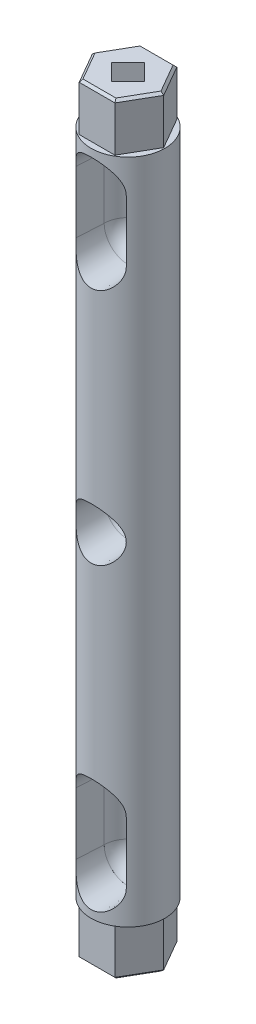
ISO-10303-21;
HEADER;
FILE_DESCRIPTION(('STEP AP214'),'2;1');
FILE_NAME('part.step','',(''),(''),'','','');
FILE_SCHEMA(('AUTOMOTIVE_DESIGN { 1 0 10303 214 1 1 1 1 }'));
ENDSEC;
DATA;
#1=APPLICATION_CONTEXT('core data for automotive mechanical design processes');
#2=APPLICATION_PROTOCOL_DEFINITION('international standard','automotive_design',2000,#1);
#3=PRODUCT_CONTEXT('',#1,'mechanical');
#4=PRODUCT('Part','Part','',(#3));
#5=PRODUCT_RELATED_PRODUCT_CATEGORY('part','',(#4));
#6=PRODUCT_DEFINITION_FORMATION('','',#4);
#7=PRODUCT_DEFINITION_CONTEXT('part definition',#1,'design');
#8=PRODUCT_DEFINITION('design','',#6,#7);
#9=PRODUCT_DEFINITION_SHAPE('','',#8);
#10=(LENGTH_UNIT() NAMED_UNIT(*) SI_UNIT(.MILLI.,.METRE.));
#11=(NAMED_UNIT(*) PLANE_ANGLE_UNIT() SI_UNIT($,.RADIAN.));
#12=(NAMED_UNIT(*) SI_UNIT($,.STERADIAN.) SOLID_ANGLE_UNIT());
#13=UNCERTAINTY_MEASURE_WITH_UNIT(LENGTH_MEASURE(1.E-05),#10,'distance_accuracy_value','');
#14=(GEOMETRIC_REPRESENTATION_CONTEXT(3) GLOBAL_UNCERTAINTY_ASSIGNED_CONTEXT((#13)) GLOBAL_UNIT_ASSIGNED_CONTEXT((#10,
#11,#12)) REPRESENTATION_CONTEXT('',''));
#15=CARTESIAN_POINT('',(0.,0.,0.));
#16=DIRECTION('',(0.,0.,1.));
#17=DIRECTION('',(1.,0.,0.));
#18=AXIS2_PLACEMENT_3D('',#15,#16,#17);
#19=CARTESIAN_POINT('',(0.,0.,0.));
#20=DIRECTION('',(0.,1.,0.));
#21=DIRECTION('',(0.,0.,1.));
#22=AXIS2_PLACEMENT_3D('',#19,#20,#21);
#23=PLANE('',#22);
#24=CARTESIAN_POINT('',(0.,0.,0.));
#25=DIRECTION('',(0.,1.,0.));
#26=DIRECTION('',(0.,0.,1.));
#27=AXIS2_PLACEMENT_3D('',#24,#25,#26);
#28=CIRCLE('',#27,7.75);
#29=CARTESIAN_POINT('',(0.,0.,7.75));
#30=VERTEX_POINT('',#29);
#31=EDGE_CURVE('E456',#30,#30,#28,.T.);
#32=ORIENTED_EDGE('',*,*,#31,.F.);
#33=EDGE_LOOP('',(#32));
#34=FACE_BOUND('',#33,.T.);
#35=DIRECTION('',(0.499999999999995,0.,0.866025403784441));
#36=VECTOR('',#35,1.);
#37=CARTESIAN_POINT('',(3.75000000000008,0.,-6.49519052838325));
#38=LINE('',#37,#36);
#39=CARTESIAN_POINT('',(3.75000000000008,0.,-6.49519052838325));
#40=VERTEX_POINT('',#39);
#41=CARTESIAN_POINT('',(7.5,0.,0.));
#42=VERTEX_POINT('',#41);
#43=EDGE_CURVE('E335',#40,#42,#38,.T.);
#44=ORIENTED_EDGE('',*,*,#43,.F.);
#45=DIRECTION('',(1.,0.,0.));
#46=VECTOR('',#45,1.);
#47=CARTESIAN_POINT('',(-3.74999999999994,0.,-6.49519052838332));
#48=LINE('',#47,#46);
#49=CARTESIAN_POINT('',(-3.74999999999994,0.,-6.49519052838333));
#50=VERTEX_POINT('',#49);
#51=EDGE_CURVE('E356',#50,#40,#48,.T.);
#52=ORIENTED_EDGE('',*,*,#51,.F.);
#53=DIRECTION('',(0.500000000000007,0.,-0.866025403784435));
#54=VECTOR('',#53,1.);
#55=CARTESIAN_POINT('',(-7.5,0.,0.));
#56=LINE('',#55,#54);
#57=CARTESIAN_POINT('',(-7.5,0.,0.));
#58=VERTEX_POINT('',#57);
#59=EDGE_CURVE('E353',#58,#50,#56,.T.);
#60=ORIENTED_EDGE('',*,*,#59,.F.);
#61=DIRECTION('',(-0.499999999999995,0.,-0.866025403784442));
#62=VECTOR('',#61,1.);
#63=CARTESIAN_POINT('',(-3.75000000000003,0.,6.49519052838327));
#64=LINE('',#63,#62);
#65=CARTESIAN_POINT('',(-3.75000000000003,0.,6.49519052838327));
#66=VERTEX_POINT('',#65);
#67=EDGE_CURVE('E350',#66,#58,#64,.T.);
#68=ORIENTED_EDGE('',*,*,#67,.F.);
#69=DIRECTION('',(-1.,0.,0.));
#70=VECTOR('',#69,1.);
#71=CARTESIAN_POINT('',(3.74999999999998,0.,6.4951905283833));
#72=LINE('',#71,#70);
#73=CARTESIAN_POINT('',(3.74999999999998,0.,6.4951905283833));
#74=VERTEX_POINT('',#73);
#75=EDGE_CURVE('E347',#74,#66,#72,.T.);
#76=ORIENTED_EDGE('',*,*,#75,.F.);
#77=DIRECTION('',(-0.500000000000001,0.,0.866025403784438));
#78=VECTOR('',#77,1.);
#79=CARTESIAN_POINT('',(7.5,0.,0.));
#80=LINE('',#79,#78);
#81=EDGE_CURVE('E344',#42,#74,#80,.T.);
#82=ORIENTED_EDGE('',*,*,#81,.F.);
#83=EDGE_LOOP('',(#44,#52,#60,#68,#76,#82));
#84=FACE_BOUND('',#83,.T.);
#85=ADVANCED_FACE('F33',(#34,#84),#23,.F.);
#86=CARTESIAN_POINT('',(0.,140.,0.));
#87=DIRECTION('',(0.,1.,0.));
#88=DIRECTION('',(0.,0.,1.));
#89=AXIS2_PLACEMENT_3D('',#86,#87,#88);
#90=PLANE('',#89);
#91=CARTESIAN_POINT('',(0.,140.,0.));
#92=DIRECTION('',(0.,1.,0.));
#93=DIRECTION('',(0.,0.,1.));
#94=AXIS2_PLACEMENT_3D('',#91,#92,#93);
#95=CIRCLE('',#94,7.75);
#96=CARTESIAN_POINT('',(0.,140.,7.75));
#97=VERTEX_POINT('',#96);
#98=EDGE_CURVE('E465',#97,#97,#95,.T.);
#99=ORIENTED_EDGE('',*,*,#98,.T.);
#100=EDGE_LOOP('',(#99));
#101=FACE_BOUND('',#100,.T.);
#102=DIRECTION('',(-0.500000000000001,0.,-0.866025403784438));
#103=VECTOR('',#102,1.);
#104=CARTESIAN_POINT('',(7.5,140.,0.));
#105=LINE('',#104,#103);
#106=CARTESIAN_POINT('',(7.5,140.,0.));
#107=VERTEX_POINT('',#106);
#108=CARTESIAN_POINT('',(3.74999999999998,140.,-6.4951905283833));
#109=VERTEX_POINT('',#108);
#110=EDGE_CURVE('E374',#107,#109,#105,.T.);
#111=ORIENTED_EDGE('',*,*,#110,.F.);
#112=DIRECTION('',(0.499999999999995,0.,-0.866025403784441));
#113=VECTOR('',#112,1.);
#114=CARTESIAN_POINT('',(3.75000000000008,140.,6.49519052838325));
#115=LINE('',#114,#113);
#116=CARTESIAN_POINT('',(3.75000000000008,140.,6.49519052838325));
#117=VERTEX_POINT('',#116);
#118=EDGE_CURVE('E371',#117,#107,#115,.T.);
#119=ORIENTED_EDGE('',*,*,#118,.F.);
#120=DIRECTION('',(1.,0.,0.));
#121=VECTOR('',#120,1.);
#122=CARTESIAN_POINT('',(-3.74999999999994,140.,6.49519052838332));
#123=LINE('',#122,#121);
#124=CARTESIAN_POINT('',(-3.74999999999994,140.,6.49519052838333));
#125=VERTEX_POINT('',#124);
#126=EDGE_CURVE('E386',#125,#117,#123,.T.);
#127=ORIENTED_EDGE('',*,*,#126,.F.);
#128=DIRECTION('',(0.500000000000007,0.,0.866025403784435));
#129=VECTOR('',#128,1.);
#130=CARTESIAN_POINT('',(-7.5,140.,0.));
#131=LINE('',#130,#129);
#132=CARTESIAN_POINT('',(-7.5,140.,0.));
#133=VERTEX_POINT('',#132);
#134=EDGE_CURVE('E383',#133,#125,#131,.T.);
#135=ORIENTED_EDGE('',*,*,#134,.F.);
#136=DIRECTION('',(-0.499999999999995,0.,0.866025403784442));
#137=VECTOR('',#136,1.);
#138=CARTESIAN_POINT('',(-3.75000000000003,140.,-6.49519052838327));
#139=LINE('',#138,#137);
#140=CARTESIAN_POINT('',(-3.75000000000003,140.,-6.49519052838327));
#141=VERTEX_POINT('',#140);
#142=EDGE_CURVE('E380',#141,#133,#139,.T.);
#143=ORIENTED_EDGE('',*,*,#142,.F.);
#144=DIRECTION('',(-1.,0.,0.));
#145=VECTOR('',#144,1.);
#146=CARTESIAN_POINT('',(3.74999999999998,140.,-6.4951905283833));
#147=LINE('',#146,#145);
#148=EDGE_CURVE('E377',#109,#141,#147,.T.);
#149=ORIENTED_EDGE('',*,*,#148,.F.);
#150=EDGE_LOOP('',(#111,#119,#127,#135,#143,#149));
#151=FACE_BOUND('',#150,.T.);
#152=ADVANCED_FACE('F495',(#101,#151),#90,.T.);
#153=CARTESIAN_POINT('',(0.,20.,0.));
#154=DIRECTION('',(0.,0.,-1.));
#155=DIRECTION('',(-1.,0.,0.));
#156=AXIS2_PLACEMENT_3D('',#153,#154,#155);
#157=PLANE('',#156);
#158=CARTESIAN_POINT('',(-0.00462783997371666,7.00628557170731,0.));
#159=DIRECTION('',(0.,0.,-1.));
#160=DIRECTION('',(-1.,0.,0.));
#161=AXIS2_PLACEMENT_3D('',#158,#159,#160);
#162=CIRCLE('',#161,4.99537611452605);
#163=CARTESIAN_POINT('',(-5.00000000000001,7.00000000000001,0.));
#164=VERTEX_POINT('',#163);
#165=CARTESIAN_POINT('',(-0.00462783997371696,2.01090945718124,0.));
#166=VERTEX_POINT('',#165);
#167=EDGE_CURVE('E1162',#164,#166,#162,.F.);
#168=ORIENTED_EDGE('',*,*,#167,.F.);
#169=CARTESIAN_POINT('',(0.,7.00000000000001,0.));
#170=DIRECTION('',(0.,0.,1.));
#171=DIRECTION('',(-1.,0.,0.));
#172=AXIS2_PLACEMENT_3D('',#169,#170,#171);
#173=CIRCLE('',#172,5.);
#174=CARTESIAN_POINT('',(5.00000000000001,7.00000000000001,0.));
#175=VERTEX_POINT('',#174);
#176=EDGE_CURVE('E425',#164,#175,#173,.T.);
#177=ORIENTED_EDGE('',*,*,#176,.T.);
#178=CARTESIAN_POINT('',(0.00462783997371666,7.00628557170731,0.));
#179=DIRECTION('',(0.,0.,-1.));
#180=DIRECTION('',(-1.,0.,0.));
#181=AXIS2_PLACEMENT_3D('',#178,#179,#180);
#182=CIRCLE('',#181,4.99537611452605);
#183=CARTESIAN_POINT('',(0.00462783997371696,2.01090945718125,0.));
#184=VERTEX_POINT('',#183);
#185=EDGE_CURVE('E1160',#184,#175,#182,.F.);
#186=ORIENTED_EDGE('',*,*,#185,.F.);
#187=DIRECTION('',(0.,1.,0.));
#188=VECTOR('',#187,1.);
#189=CARTESIAN_POINT('',(0.00462783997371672,140.,0.));
#190=LINE('',#189,#188);
#191=CARTESIAN_POINT('',(0.00462783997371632,24.9953721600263,0.));
#192=VERTEX_POINT('',#191);
#193=EDGE_CURVE('E1232',#192,#184,#190,.F.);
#194=ORIENTED_EDGE('',*,*,#193,.F.);
#195=CARTESIAN_POINT('',(0.00462783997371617,20.,0.));
#196=DIRECTION('',(0.,0.,-1.));
#197=DIRECTION('',(-1.,0.,0.));
#198=AXIS2_PLACEMENT_3D('',#195,#196,#197);
#199=CIRCLE('',#198,4.99537216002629);
#200=CARTESIAN_POINT('',(5.,20.,0.));
#201=VERTEX_POINT('',#200);
#202=EDGE_CURVE('E1154',#201,#192,#199,.F.);
#203=ORIENTED_EDGE('',*,*,#202,.F.);
#204=CARTESIAN_POINT('',(0.,20.,0.));
#205=DIRECTION('',(0.,0.,1.));
#206=DIRECTION('',(-1.,0.,0.));
#207=AXIS2_PLACEMENT_3D('',#204,#205,#206);
#208=CIRCLE('',#207,5.);
#209=CARTESIAN_POINT('',(-5.,20.,0.));
#210=VERTEX_POINT('',#209);
#211=EDGE_CURVE('E420',#201,#210,#208,.T.);
#212=ORIENTED_EDGE('',*,*,#211,.T.);
#213=CARTESIAN_POINT('',(-0.00462783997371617,20.,0.));
#214=DIRECTION('',(0.,0.,-1.));
#215=DIRECTION('',(-1.,0.,0.));
#216=AXIS2_PLACEMENT_3D('',#213,#214,#215);
#217=CIRCLE('',#216,4.99537216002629);
#218=CARTESIAN_POINT('',(-0.0046279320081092,24.9953721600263,0.));
#219=VERTEX_POINT('',#218);
#220=EDGE_CURVE('E1171',#219,#210,#217,.F.);
#221=ORIENTED_EDGE('',*,*,#220,.F.);
#222=DIRECTION('',(0.,1.,0.));
#223=VECTOR('',#222,1.);
#224=CARTESIAN_POINT('',(-0.00462783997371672,140.,0.));
#225=LINE('',#224,#223);
#226=EDGE_CURVE('E1165',#166,#219,#225,.T.);
#227=ORIENTED_EDGE('',*,*,#226,.F.);
#228=EDGE_LOOP('',(#168,#177,#186,#194,#203,#212,#221,#227));
#229=FACE_BOUND('',#228,.T.);
#230=ADVANCED_FACE('F497',(#229),#157,.F.);
#231=CARTESIAN_POINT('',(0.,140.,0.));
#232=DIRECTION('',(0.,-1.,0.));
#233=DIRECTION('',(0.,0.,-1.));
#234=AXIS2_PLACEMENT_3D('',#231,#232,#233);
#235=CYLINDRICAL_SURFACE('',#234,7.75);
#236=ORIENTED_EDGE('',*,*,#98,.F.);
#237=EDGE_LOOP('',(#236));
#238=FACE_BOUND('',#237,.T.);
#239=ORIENTED_EDGE('',*,*,#31,.T.);
#240=EDGE_LOOP('',(#239));
#241=FACE_BOUND('',#240,.T.);
#242=CARTESIAN_POINT('',(-4.03726198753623,66.4946214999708,6.61536209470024));
#243=CARTESIAN_POINT('',(-3.84736140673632,66.2666579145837,6.7312434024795));
#244=CARTESIAN_POINT('',(-3.63844280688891,66.0543548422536,6.84746060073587));
#245=CARTESIAN_POINT('',(-3.29847803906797,65.7628467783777,7.01417071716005));
#246=CARTESIAN_POINT('',(-3.18062442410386,65.6701075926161,7.06851032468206));
#247=CARTESIAN_POINT('',(-2.9362814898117,65.4942627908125,7.17345098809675));
#248=CARTESIAN_POINT('',(-2.80979134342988,65.4111580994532,7.22405168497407));
#249=CARTESIAN_POINT('',(-2.54757129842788,65.2547740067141,7.32066099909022));
#250=CARTESIAN_POINT('',(-2.41177136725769,65.1815851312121,7.36662643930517));
#251=CARTESIAN_POINT('',(-2.13267599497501,65.0468443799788,7.45221286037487));
#252=CARTESIAN_POINT('',(-1.98938471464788,64.985286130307,7.49183731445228));
#253=CARTESIAN_POINT('',(-1.69638803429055,64.8747910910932,7.56356302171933));
#254=CARTESIAN_POINT('',(-1.54669058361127,64.8258391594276,7.59567329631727));
#255=CARTESIAN_POINT('',(-1.24201549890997,64.7413796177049,7.6513958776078));
#256=CARTESIAN_POINT('',(-1.0870390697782,64.7058689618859,7.67501010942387));
#257=CARTESIAN_POINT('',(-0.796053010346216,64.6531393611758,7.71019316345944));
#258=CARTESIAN_POINT('',(-0.66053550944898,64.6340197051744,7.72300884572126));
#259=CARTESIAN_POINT('',(-0.387939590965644,64.6064847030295,7.7414892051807));
#260=CARTESIAN_POINT('',(-0.250861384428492,64.5980679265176,7.74715483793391));
#261=CARTESIAN_POINT('',(0.0235878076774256,64.5920877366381,7.75117883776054));
#262=CARTESIAN_POINT('',(0.160958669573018,64.594520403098,7.74953984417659));
#263=CARTESIAN_POINT('',(0.434796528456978,64.6101856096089,7.73900675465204));
#264=CARTESIAN_POINT('',(0.571263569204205,64.6234176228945,7.73011301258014));
#265=CARTESIAN_POINT('',(0.827481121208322,64.6584503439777,7.70665245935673));
#266=CARTESIAN_POINT('',(0.947446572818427,64.6791724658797,7.69280129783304));
#267=CARTESIAN_POINT('',(1.18495761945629,64.7287475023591,7.65981582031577));
#268=CARTESIAN_POINT('',(1.3025024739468,64.7576028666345,7.6406799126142));
#269=CARTESIAN_POINT('',(1.65037923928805,64.8558592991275,7.57589735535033));
#270=CARTESIAN_POINT('',(1.87615124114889,64.9369784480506,7.52285686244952));
#271=CARTESIAN_POINT('',(2.32417897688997,65.1328966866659,7.39717781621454));
#272=CARTESIAN_POINT('',(2.54536620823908,65.2494590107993,7.32353529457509));
#273=CARTESIAN_POINT('',(2.96584725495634,65.5099934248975,7.16358057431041));
#274=CARTESIAN_POINT('',(3.16513416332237,65.6539741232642,7.0772643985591));
#275=CARTESIAN_POINT('',(3.5712801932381,65.9920143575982,6.88238876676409));
#276=CARTESIAN_POINT('',(3.77388320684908,66.1904202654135,6.7725178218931));
#277=CARTESIAN_POINT('',(4.14555945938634,66.6168198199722,6.55161171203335));
#278=CARTESIAN_POINT('',(4.31456251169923,66.8448737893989,6.44057460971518));
#279=CARTESIAN_POINT('',(4.55108241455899,67.2233348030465,6.27385038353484));
#280=CARTESIAN_POINT('',(4.63091829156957,67.3647706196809,6.21495874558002));
#281=CARTESIAN_POINT('',(4.77833827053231,67.6559686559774,6.10234172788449));
#282=CARTESIAN_POINT('',(4.84591956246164,67.8057327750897,6.0486175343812));
#283=CARTESIAN_POINT('',(4.96783444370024,68.1124990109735,5.94889188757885));
#284=CARTESIAN_POINT('',(5.02220641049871,68.2694785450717,5.90286818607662));
#285=CARTESIAN_POINT('',(5.11700687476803,68.5901111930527,5.8208835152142));
#286=CARTESIAN_POINT('',(5.15744461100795,68.7537598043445,5.78491588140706));
#287=CARTESIAN_POINT('',(5.21285079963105,69.032869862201,5.73494454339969));
#288=CARTESIAN_POINT('',(5.23182828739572,69.1469534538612,5.7175962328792));
#289=CARTESIAN_POINT('',(5.2626626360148,69.3768486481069,5.68922892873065));
#290=CARTESIAN_POINT('',(5.27452127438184,69.4926598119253,5.67820835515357));
#291=CARTESIAN_POINT('',(5.29092737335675,69.7251415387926,5.66292451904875));
#292=CARTESIAN_POINT('',(5.29548133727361,69.8418112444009,5.65865524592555));
#293=CARTESIAN_POINT('',(5.2972236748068,70.0752595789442,5.65702416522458));
#294=CARTESIAN_POINT('',(5.29441172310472,70.1920382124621,5.65966266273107));
#295=CARTESIAN_POINT('',(5.28147526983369,70.4246837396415,5.67173682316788));
#296=CARTESIAN_POINT('',(5.27136018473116,70.5405516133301,5.6811637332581));
#297=CARTESIAN_POINT('',(5.24399201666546,70.7707493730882,5.70643338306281));
#298=CARTESIAN_POINT('',(5.22673653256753,70.885078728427,5.72227828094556));
#299=CARTESIAN_POINT('',(5.16457675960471,71.2248666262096,5.77865509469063));
#300=CARTESIAN_POINT('',(5.10928479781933,71.4470283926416,5.82802336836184));
#301=CARTESIAN_POINT('',(4.95130119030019,71.9487194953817,5.96330228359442));
#302=CARTESIAN_POINT('',(4.83904336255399,72.2234160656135,6.05587525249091));
#303=CARTESIAN_POINT('',(4.64115913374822,72.6153438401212,6.20718075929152));
#304=CARTESIAN_POINT('',(4.5701760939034,72.7427776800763,6.25976253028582));
#305=CARTESIAN_POINT('',(4.41873252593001,72.990709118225,6.36756980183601));
#306=CARTESIAN_POINT('',(4.33827274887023,73.1112072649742,6.42279509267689));
#307=CARTESIAN_POINT('',(4.08016412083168,73.4659760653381,6.59223033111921));
#308=CARTESIAN_POINT('',(3.88805414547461,73.6890398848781,6.70837932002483));
#309=CARTESIAN_POINT('',(3.46825272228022,74.101730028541,6.93474162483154));
#310=CARTESIAN_POINT('',(3.24059607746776,74.291388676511,7.04496060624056));
#311=CARTESIAN_POINT('',(2.77704715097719,74.614870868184,7.23925315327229));
#312=CARTESIAN_POINT('',(2.54445743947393,74.7524450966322,7.32485276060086));
#313=CARTESIAN_POINT('',(2.17812150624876,74.9320169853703,7.43873159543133));
#314=CARTESIAN_POINT('',(2.05305501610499,74.9874237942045,7.4742808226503));
#315=CARTESIAN_POINT('',(1.79771467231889,75.0886749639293,7.53976502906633));
#316=CARTESIAN_POINT('',(1.66744323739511,75.1345237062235,7.56970258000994));
#317=CARTESIAN_POINT('',(1.40149144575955,75.2163418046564,7.62344195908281));
#318=CARTESIAN_POINT('',(1.26577804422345,75.2522350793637,7.64719645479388));
#319=CARTESIAN_POINT('',(0.990880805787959,75.3131173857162,7.68764918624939));
#320=CARTESIAN_POINT('',(0.851696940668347,75.3381063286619,7.70434736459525));
#321=CARTESIAN_POINT('',(0.571150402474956,75.3767256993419,7.73020820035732));
#322=CARTESIAN_POINT('',(0.429789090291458,75.3903629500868,7.7393753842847));
#323=CARTESIAN_POINT('',(0.146142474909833,75.4060461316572,7.74992101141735));
#324=CARTESIAN_POINT('',(0.00385728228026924,75.4080934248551,7.75130037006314));
#325=CARTESIAN_POINT('',(-0.262908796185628,75.4010242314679,7.74654431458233));
#326=CARTESIAN_POINT('',(-0.387443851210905,75.3932393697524,7.74130525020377));
#327=CARTESIAN_POINT('',(-0.635292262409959,75.3688240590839,7.72491635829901));
#328=CARTESIAN_POINT('',(-0.75860520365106,75.3521907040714,7.71376458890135));
#329=CARTESIAN_POINT('',(-1.00306313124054,75.3103138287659,7.68579789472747));
#330=CARTESIAN_POINT('',(-1.12420884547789,75.2850732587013,7.66898491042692));
#331=CARTESIAN_POINT('',(-1.36362368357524,75.226317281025,7.63005719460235));
#332=CARTESIAN_POINT('',(-1.48189167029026,75.1927986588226,7.60794040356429));
#333=CARTESIAN_POINT('',(-1.83174312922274,75.0802640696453,7.53418348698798));
#334=CARTESIAN_POINT('',(-2.05807488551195,74.9893217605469,7.47517258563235));
#335=CARTESIAN_POINT('',(-2.49222262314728,74.7794220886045,7.34187140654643));
#336=CARTESIAN_POINT('',(-2.70003448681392,74.660458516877,7.26757774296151));
#337=CARTESIAN_POINT('',(-3.12247535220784,74.3796096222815,7.09728379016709));
#338=CARTESIAN_POINT('',(-3.33401962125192,74.2140533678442,6.99970136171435));
#339=CARTESIAN_POINT('',(-3.72847748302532,73.8547715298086,6.7978032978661));
#340=CARTESIAN_POINT('',(-3.9113493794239,73.6610056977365,6.69347816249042));
#341=CARTESIAN_POINT('',(-4.17711826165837,73.3338657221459,6.52897695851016));
#342=CARTESIAN_POINT('',(-4.27005391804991,73.2087145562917,6.46841018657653));
#343=CARTESIAN_POINT('',(-4.44514478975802,72.9501474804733,6.34936307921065));
#344=CARTESIAN_POINT('',(-4.52729765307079,72.8167297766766,6.29088320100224));
#345=CARTESIAN_POINT('',(-4.75670373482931,72.4048630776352,6.12145577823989));
#346=CARTESIAN_POINT('',(-4.88733825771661,72.1142684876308,6.01623852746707));
#347=CARTESIAN_POINT('',(-5.07037311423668,71.5856096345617,5.8621095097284));
#348=CARTESIAN_POINT('',(-5.13430633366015,71.3537587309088,5.80566791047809));
#349=CARTESIAN_POINT('',(-5.2074215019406,70.9980341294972,5.73988632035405));
#350=CARTESIAN_POINT('',(-5.22799257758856,70.8781776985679,5.7211091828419));
#351=CARTESIAN_POINT('',(-5.26126567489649,70.6365191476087,5.6905279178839));
#352=CARTESIAN_POINT('',(-5.27397078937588,70.5147178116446,5.67872104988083));
#353=CARTESIAN_POINT('',(-5.29134247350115,70.2693969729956,5.66253794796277));
#354=CARTESIAN_POINT('',(-5.29596613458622,70.1458717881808,5.6582013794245));
#355=CARTESIAN_POINT('',(-5.29695868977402,69.8987590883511,5.65727225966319));
#356=CARTESIAN_POINT('',(-5.29332757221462,69.7751715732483,5.6606797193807));
#357=CARTESIAN_POINT('',(-5.27787052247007,69.5288687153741,5.67509422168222));
#358=CARTESIAN_POINT('',(-5.26603873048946,69.4061540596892,5.68610669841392));
#359=CARTESIAN_POINT('',(-5.23439435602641,69.1626474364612,5.71524870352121));
#360=CARTESIAN_POINT('',(-5.21458169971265,69.0418554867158,5.73337829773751));
#361=CARTESIAN_POINT('',(-5.14649043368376,68.6980866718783,5.7948051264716));
#362=CARTESIAN_POINT('',(-5.08848592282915,68.478402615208,5.8462301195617));
#363=CARTESIAN_POINT('',(-4.94779455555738,68.0521469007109,5.96575845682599));
#364=CARTESIAN_POINT('',(-4.86510276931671,67.8455778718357,6.03386513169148));
#365=CARTESIAN_POINT('',(-4.67257768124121,67.4375081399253,6.18426411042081));
#366=CARTESIAN_POINT('',(-4.5616295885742,67.2367299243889,6.26708140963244));
#367=CARTESIAN_POINT('',(-4.31659103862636,66.8524489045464,6.43831896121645));
#368=CARTESIAN_POINT('',(-4.18248773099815,66.6689557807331,6.5267423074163));
#369=CARTESIAN_POINT('',(-4.03726198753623,66.4946214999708,6.61536209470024));
#370=B_SPLINE_CURVE_WITH_KNOTS('',3,(#242,#243,#244,#245,#246,#247,#248,#249,#250,#251,#252,
#253,#254,#255,#256,#257,#258,#259,#260,#261,#262,#263,#264,#265,#266,#267,#268,#269,#270,#271,
#272,#273,#274,#275,#276,#277,#278,#279,#280,#281,#282,#283,#284,#285,#286,#287,#288,#289,#290,
#291,#292,#293,#294,#295,#296,#297,#298,#299,#300,#301,#302,#303,#304,#305,#306,#307,#308,#309,
#310,#311,#312,#313,#314,#315,#316,#317,#318,#319,#320,#321,#322,#323,#324,#325,#326,#327,#328,
#329,#330,#331,#332,#333,#334,#335,#336,#337,#338,#339,#340,#341,#342,#343,#344,#345,#346,#347,
#348,#349,#350,#351,#352,#353,#354,#355,#356,#357,#358,#359,#360,#361,#362,#363,#364,#365,#366,
#367,#368,#369),.UNSPECIFIED.,.T.,.F.,(4,2,2,2,2,2,2,2,2,2,2,2,2,2,2,2,2,2,2,2,2,2,2,2,2,2,2,2,
2,2,2,2,2,2,2,2,2,2,2,2,2,2,2,2,2,2,2,2,2,2,2,2,2,2,2,2,2,2,2,2,2,2,2,4),(0.,0.954687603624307,
1.43276724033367,1.91089272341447,2.39312507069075,2.87509236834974,3.35647802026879,
3.83775452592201,4.2495446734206,4.66127978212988,5.07286613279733,5.48443240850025,
5.8515917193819,6.21886173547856,6.95280658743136,7.73184975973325,8.51113792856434,
9.42007413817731,10.3308895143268,10.8485811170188,11.3663912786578,11.8826785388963,
12.3986228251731,12.7490995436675,13.0994887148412,13.4495657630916,13.7996582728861,
14.1493001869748,14.4990597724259,15.1988662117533,16.1262012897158,16.5910119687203,
17.0557858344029,18.0011917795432,18.9456778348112,19.7922141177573,20.215773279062,
20.6391378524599,21.0656538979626,21.4921734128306,21.918436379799,22.3446492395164,
22.7188595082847,23.0931927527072,23.4673978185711,23.84174842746,24.5913565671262,
25.3411309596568,26.1953764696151,27.0508529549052,27.5520386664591,28.0533335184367,
29.0537231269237,29.7917227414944,30.1604656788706,30.5290635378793,30.8996125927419,
31.2701621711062,31.6409767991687,32.0117948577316,32.707835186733,33.4040146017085,
34.1337020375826,34.8637957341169),.UNSPECIFIED.);
#371=CARTESIAN_POINT('',(-4.03726198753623,66.4946214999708,6.61536209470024));
#372=VERTEX_POINT('',#371);
#373=EDGE_CURVE('E468',#372,#372,#370,.T.);
#374=ORIENTED_EDGE('',*,*,#373,.F.);
#375=EDGE_LOOP('',(#374));
#376=FACE_BOUND('',#375,.T.);
#377=CARTESIAN_POINT('',(-5.29650722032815,120.0002,5.65769487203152));
#378=CARTESIAN_POINT('',(-5.29654371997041,119.868469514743,5.65761770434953));
#379=CARTESIAN_POINT('',(-5.29183376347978,119.736779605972,5.66206943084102));
#380=CARTESIAN_POINT('',(-5.27317306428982,119.474786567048,5.67947501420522));
#381=CARTESIAN_POINT('',(-5.2592342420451,119.344481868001,5.69241790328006));
#382=CARTESIAN_POINT('',(-5.22254302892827,119.087454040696,5.72609102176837));
#383=CARTESIAN_POINT('',(-5.19987618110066,118.960708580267,5.74674561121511));
#384=CARTESIAN_POINT('',(-5.14610585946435,118.710339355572,5.79494644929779));
#385=CARTESIAN_POINT('',(-5.11500001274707,118.586716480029,5.8224946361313));
#386=CARTESIAN_POINT('',(-5.04494983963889,118.343877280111,5.88329107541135));
#387=CARTESIAN_POINT('',(-5.00604568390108,118.224641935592,5.91650999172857));
#388=CARTESIAN_POINT('',(-4.92071715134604,117.990384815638,5.98766489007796));
#389=CARTESIAN_POINT('',(-4.8742931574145,117.875362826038,6.02560063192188));
#390=CARTESIAN_POINT('',(-4.72403303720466,117.536484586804,6.1451112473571));
#391=CARTESIAN_POINT('',(-4.60935821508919,117.319326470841,6.23225365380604));
#392=CARTESIAN_POINT('',(-4.33184276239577,116.869666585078,6.42893119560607));
#393=CARTESIAN_POINT('',(-4.16414457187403,116.640729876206,6.53976715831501));
#394=CARTESIAN_POINT('',(-3.88714454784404,116.319261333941,6.70553999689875));
#395=CARTESIAN_POINT('',(-3.79050221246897,116.215704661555,6.76075102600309));
#396=CARTESIAN_POINT('',(-3.58885318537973,116.016253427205,6.86991711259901));
#397=CARTESIAN_POINT('',(-3.48384456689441,115.920360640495,6.92387187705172));
#398=CARTESIAN_POINT('',(-3.2508770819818,115.724287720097,7.03656497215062));
#399=CARTESIAN_POINT('',(-3.12174007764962,115.625301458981,7.09495441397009));
#400=CARTESIAN_POINT('',(-2.85352969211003,115.438892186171,7.20700877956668));
#401=CARTESIAN_POINT('',(-2.71446108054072,115.351463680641,7.26067594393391));
#402=CARTESIAN_POINT('',(-2.42718159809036,115.189293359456,7.36168742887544));
#403=CARTESIAN_POINT('',(-2.2789830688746,115.114534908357,7.40904002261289));
#404=CARTESIAN_POINT('',(-1.97426968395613,114.978759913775,7.49598735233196));
#405=CARTESIAN_POINT('',(-1.81775852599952,114.917737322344,7.53558550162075));
#406=CARTESIAN_POINT('',(-1.54137618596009,114.825188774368,7.59610937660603));
#407=CARTESIAN_POINT('',(-1.42313647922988,114.7901558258,7.6191832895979));
#408=CARTESIAN_POINT('',(-1.18362402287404,114.728383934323,7.66004442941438));
#409=CARTESIAN_POINT('',(-1.06235191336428,114.701643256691,7.6778327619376));
#410=CARTESIAN_POINT('',(-0.817603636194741,114.656815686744,7.70773733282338));
#411=CARTESIAN_POINT('',(-0.694128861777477,114.638723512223,7.71985703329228));
#412=CARTESIAN_POINT('',(-0.44575623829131,114.611421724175,7.7381720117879));
#413=CARTESIAN_POINT('',(-0.320858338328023,114.602212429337,7.74436707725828));
#414=CARTESIAN_POINT('',(-0.0703794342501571,114.592806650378,7.7506944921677));
#415=CARTESIAN_POINT('',(0.0552023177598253,114.592623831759,7.75081764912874));
#416=CARTESIAN_POINT('',(0.305954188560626,114.601309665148,7.74497423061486));
#417=CARTESIAN_POINT('',(0.431124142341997,114.610181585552,7.73900545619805));
#418=CARTESIAN_POINT('',(0.680059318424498,114.636848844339,7.72111327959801));
#419=CARTESIAN_POINT('',(0.803824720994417,114.654643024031,7.70919065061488));
#420=CARTESIAN_POINT('',(1.04914597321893,114.698909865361,7.67965269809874));
#421=CARTESIAN_POINT('',(1.17070094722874,114.725385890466,7.66203516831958));
#422=CARTESIAN_POINT('',(1.40858269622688,114.7861066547,7.62185507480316));
#423=CARTESIAN_POINT('',(1.52496444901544,114.820200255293,7.5993889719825));
#424=CARTESIAN_POINT('',(1.75420404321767,114.896023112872,7.54977120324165));
#425=CARTESIAN_POINT('',(1.86706064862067,114.937755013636,7.52261791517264));
#426=CARTESIAN_POINT('',(2.19945871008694,115.07375590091,7.43486934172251));
#427=CARTESIAN_POINT('',(2.41300140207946,115.178874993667,7.36795503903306));
#428=CARTESIAN_POINT('',(2.84435280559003,115.428133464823,7.21322711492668));
#429=CARTESIAN_POINT('',(3.05979578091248,115.575380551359,7.12389110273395));
#430=CARTESIAN_POINT('',(3.46459333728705,115.897467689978,6.93606433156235));
#431=CARTESIAN_POINT('',(3.65392039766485,116.072336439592,6.83756409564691));
#432=CARTESIAN_POINT('',(4.03610680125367,116.479915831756,6.62032244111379));
#433=CARTESIAN_POINT('',(4.22366891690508,116.717386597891,6.50108217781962));
#434=CARTESIAN_POINT('',(4.47432248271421,117.096526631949,6.32876796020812));
#435=CARTESIAN_POINT('',(4.55278852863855,117.226795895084,6.27239584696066));
#436=CARTESIAN_POINT('',(4.69908016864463,117.49470952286,6.16355709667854));
#437=CARTESIAN_POINT('',(4.76690716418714,117.632352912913,6.11108994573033));
#438=CARTESIAN_POINT('',(4.92916135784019,118.000516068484,5.98182524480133));
#439=CARTESIAN_POINT('',(5.01477612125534,118.236739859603,5.90956799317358));
#440=CARTESIAN_POINT('',(5.11895127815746,118.601803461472,5.81901639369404));
#441=CARTESIAN_POINT('',(5.14961360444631,118.725130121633,5.79182614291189));
#442=CARTESIAN_POINT('',(5.20254361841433,118.974859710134,5.74432749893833));
#443=CARTESIAN_POINT('',(5.22481519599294,119.101261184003,5.72401591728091));
#444=CARTESIAN_POINT('',(5.26050568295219,119.355718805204,5.69123903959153));
#445=CARTESIAN_POINT('',(5.27396494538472,119.483764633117,5.67873799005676));
#446=CARTESIAN_POINT('',(5.29199104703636,119.741258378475,5.66192219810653));
#447=CARTESIAN_POINT('',(5.29654063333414,119.870708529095,5.65762333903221));
#448=CARTESIAN_POINT('',(5.29650722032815,120.0002,5.65769487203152));
#449=B_SPLINE_CURVE_WITH_KNOTS('',3,(#377,#378,#379,#380,#381,#382,#383,#384,#385,#386,#387,
#388,#389,#390,#391,#392,#393,#394,#395,#396,#397,#398,#399,#400,#401,#402,#403,#404,#405,#406,
#407,#408,#409,#410,#411,#412,#413,#414,#415,#416,#417,#418,#419,#420,#421,#422,#423,#424,#425,
#426,#427,#428,#429,#430,#431,#432,#433,#434,#435,#436,#437,#438,#439,#440,#441,#442,#443,#444,
#445,#446,#447,#448),.UNSPECIFIED.,.F.,.F.,(4,2,2,2,2,2,2,2,2,2,2,2,2,2,2,2,2,2,2,2,2,2,2,2,2,2,
2,2,2,2,2,2,2,2,2,4),(0.,0.394966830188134,0.789424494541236,1.18011064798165,1.57090677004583,
1.95973929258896,2.34855202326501,3.12780825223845,4.0381649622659,4.49390079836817,
4.94974189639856,5.46764674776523,5.98530452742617,6.50227728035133,7.01902196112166,
7.39501812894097,7.77093558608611,8.14662315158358,8.5223241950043,8.89859400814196,
9.274999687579,9.65135649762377,10.0278592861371,10.3974675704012,10.7672040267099,
11.5061388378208,12.330580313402,13.1558840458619,14.1271496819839,14.6132417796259,
15.0992697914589,15.8800373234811,16.269518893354,16.658819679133,17.0463250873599,
17.4345801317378),.UNSPECIFIED.);
#450=CARTESIAN_POINT('',(-5.29650722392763,120.,5.65769486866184));
#451=VERTEX_POINT('',#450);
#452=CARTESIAN_POINT('',(5.29650722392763,120.,5.65769486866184));
#453=VERTEX_POINT('',#452);
#454=EDGE_CURVE('E477',#451,#453,#449,.T.);
#455=ORIENTED_EDGE('',*,*,#454,.F.);
#456=DIRECTION('',(0.,-1.,0.));
#457=VECTOR('',#456,1.);
#458=CARTESIAN_POINT('',(-5.29650722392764,140.,5.65769486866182));
#459=LINE('',#458,#457);
#460=CARTESIAN_POINT('',(-5.29650722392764,133.,5.65769486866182));
#461=VERTEX_POINT('',#460);
#462=EDGE_CURVE('E1149',#461,#451,#459,.T.);
#463=ORIENTED_EDGE('',*,*,#462,.F.);
#464=CARTESIAN_POINT('',(5.29650722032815,132.9998,5.65769487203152));
#465=CARTESIAN_POINT('',(5.29654371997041,133.131530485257,5.65761770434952));
#466=CARTESIAN_POINT('',(5.29183376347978,133.263220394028,5.66206943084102));
#467=CARTESIAN_POINT('',(5.27317306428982,133.525213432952,5.67947501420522));
#468=CARTESIAN_POINT('',(5.2592342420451,133.655518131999,5.69241790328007));
#469=CARTESIAN_POINT('',(5.22254302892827,133.912545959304,5.72609102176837));
#470=CARTESIAN_POINT('',(5.19987618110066,134.039291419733,5.7467456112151));
#471=CARTESIAN_POINT('',(5.14610585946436,134.289660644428,5.79494644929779));
#472=CARTESIAN_POINT('',(5.11500001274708,134.413283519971,5.82249463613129));
#473=CARTESIAN_POINT('',(5.0449498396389,134.656122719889,5.88329107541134));
#474=CARTESIAN_POINT('',(5.00604568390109,134.775358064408,5.91650999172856));
#475=CARTESIAN_POINT('',(4.92071715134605,135.009615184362,5.98766489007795));
#476=CARTESIAN_POINT('',(4.87429315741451,135.124637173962,6.02560063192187));
#477=CARTESIAN_POINT('',(4.72403303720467,135.463515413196,6.14511124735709));
#478=CARTESIAN_POINT('',(4.6093582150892,135.680673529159,6.23225365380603));
#479=CARTESIAN_POINT('',(4.33184276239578,136.130333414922,6.42893119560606));
#480=CARTESIAN_POINT('',(4.16414457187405,136.359270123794,6.539767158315));
#481=CARTESIAN_POINT('',(3.88714454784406,136.680738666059,6.70553999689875));
#482=CARTESIAN_POINT('',(3.79050221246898,136.784295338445,6.76075102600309));
#483=CARTESIAN_POINT('',(3.58885318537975,136.983746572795,6.869917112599));
#484=CARTESIAN_POINT('',(3.48384456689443,137.079639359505,6.92387187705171));
#485=CARTESIAN_POINT('',(3.25087708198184,137.275712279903,7.0365649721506));
#486=CARTESIAN_POINT('',(3.12174007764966,137.374698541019,7.09495441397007));
#487=CARTESIAN_POINT('',(2.85352969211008,137.561107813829,7.20700877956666));
#488=CARTESIAN_POINT('',(2.71446108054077,137.648536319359,7.26067594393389));
#489=CARTESIAN_POINT('',(2.42718159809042,137.810706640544,7.36168742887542));
#490=CARTESIAN_POINT('',(2.27898306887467,137.885465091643,7.40904002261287));
#491=CARTESIAN_POINT('',(1.9742696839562,138.021240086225,7.49598735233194));
#492=CARTESIAN_POINT('',(1.81775852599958,138.082262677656,7.53558550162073));
#493=CARTESIAN_POINT('',(1.54137618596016,138.174811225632,7.59610937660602));
#494=CARTESIAN_POINT('',(1.42313647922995,138.2098441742,7.61918328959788));
#495=CARTESIAN_POINT('',(1.18362402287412,138.271616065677,7.66004442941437));
#496=CARTESIAN_POINT('',(1.06235191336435,138.298356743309,7.67783276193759));
#497=CARTESIAN_POINT('',(0.817603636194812,138.343184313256,7.70773733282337));
#498=CARTESIAN_POINT('',(0.69412886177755,138.361276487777,7.71985703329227));
#499=CARTESIAN_POINT('',(0.445756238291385,138.388578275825,7.73817201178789));
#500=CARTESIAN_POINT('',(0.320858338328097,138.397787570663,7.74436707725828));
#501=CARTESIAN_POINT('',(0.0703794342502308,138.407193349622,7.75069449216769));
#502=CARTESIAN_POINT('',(-0.055202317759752,138.407376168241,7.75081764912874));
#503=CARTESIAN_POINT('',(-0.305954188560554,138.398690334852,7.74497423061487));
#504=CARTESIAN_POINT('',(-0.431124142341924,138.389818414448,7.73900545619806));
#505=CARTESIAN_POINT('',(-0.680059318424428,138.363151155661,7.72111327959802));
#506=CARTESIAN_POINT('',(-0.80382472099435,138.345356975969,7.70919065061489));
#507=CARTESIAN_POINT('',(-1.04914597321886,138.30109013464,7.67965269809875));
#508=CARTESIAN_POINT('',(-1.17070094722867,138.274614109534,7.66203516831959));
#509=CARTESIAN_POINT('',(-1.40858269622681,138.2138933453,7.62185507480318));
#510=CARTESIAN_POINT('',(-1.52496444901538,138.179799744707,7.59938897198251));
#511=CARTESIAN_POINT('',(-1.7542040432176,138.103976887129,7.54977120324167));
#512=CARTESIAN_POINT('',(-1.86706064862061,138.062244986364,7.52261791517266));
#513=CARTESIAN_POINT('',(-2.19945871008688,137.92624409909,7.43486934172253));
#514=CARTESIAN_POINT('',(-2.4130014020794,137.821125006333,7.36795503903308));
#515=CARTESIAN_POINT('',(-2.84435280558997,137.571866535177,7.21322711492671));
#516=CARTESIAN_POINT('',(-3.05979578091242,137.424619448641,7.12389110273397));
#517=CARTESIAN_POINT('',(-3.464593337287,137.102532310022,6.93606433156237));
#518=CARTESIAN_POINT('',(-3.6539203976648,136.927663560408,6.83756409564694));
#519=CARTESIAN_POINT('',(-4.03610680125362,136.520084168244,6.62032244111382));
#520=CARTESIAN_POINT('',(-4.22366891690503,136.282613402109,6.50108217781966));
#521=CARTESIAN_POINT('',(-4.47432248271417,135.903473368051,6.32876796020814));
#522=CARTESIAN_POINT('',(-4.55278852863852,135.773204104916,6.27239584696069));
#523=CARTESIAN_POINT('',(-4.6990801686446,135.50529047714,6.16355709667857));
#524=CARTESIAN_POINT('',(-4.7669071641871,135.367647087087,6.11108994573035));
#525=CARTESIAN_POINT('',(-4.92916135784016,134.999483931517,5.98182524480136));
#526=CARTESIAN_POINT('',(-5.01477612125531,134.763260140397,5.90956799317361));
#527=CARTESIAN_POINT('',(-5.11895127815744,134.398196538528,5.81901639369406));
#528=CARTESIAN_POINT('',(-5.14961360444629,134.274869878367,5.7918261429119));
#529=CARTESIAN_POINT('',(-5.20254361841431,134.025140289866,5.74432749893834));
#530=CARTESIAN_POINT('',(-5.22481519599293,133.898738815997,5.72401591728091));
#531=CARTESIAN_POINT('',(-5.26050568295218,133.644281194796,5.69123903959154));
#532=CARTESIAN_POINT('',(-5.27396494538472,133.516235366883,5.67873799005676));
#533=CARTESIAN_POINT('',(-5.29199104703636,133.258741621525,5.66192219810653));
#534=CARTESIAN_POINT('',(-5.29654063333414,133.129291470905,5.65762333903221));
#535=CARTESIAN_POINT('',(-5.29650722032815,132.9998,5.65769487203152));
#536=B_SPLINE_CURVE_WITH_KNOTS('',3,(#464,#465,#466,#467,#468,#469,#470,#471,#472,#473,#474,
#475,#476,#477,#478,#479,#480,#481,#482,#483,#484,#485,#486,#487,#488,#489,#490,#491,#492,#493,
#494,#495,#496,#497,#498,#499,#500,#501,#502,#503,#504,#505,#506,#507,#508,#509,#510,#511,#512,
#513,#514,#515,#516,#517,#518,#519,#520,#521,#522,#523,#524,#525,#526,#527,#528,#529,#530,#531,
#532,#533,#534,#535),.UNSPECIFIED.,.F.,.F.,(4,2,2,2,2,2,2,2,2,2,2,2,2,2,2,2,2,2,2,2,2,2,2,2,2,2,
2,2,2,2,2,2,2,2,2,4),(0.,0.394966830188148,0.789424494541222,1.18011064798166,1.5709067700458,
1.95973929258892,2.34855202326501,3.12780825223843,4.03816496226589,4.49390079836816,
4.94974189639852,5.46764674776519,5.9853045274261,6.50227728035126,7.01902196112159,
7.39501812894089,7.77093558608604,8.1466231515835,8.52232419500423,8.89859400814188,
9.27499968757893,9.65135649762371,10.027859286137,10.3974675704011,10.7672040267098,
11.5061388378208,12.3305803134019,13.1558840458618,14.1271496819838,14.6132417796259,
15.0992697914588,15.880037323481,16.269518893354,16.658819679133,17.0463250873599,
17.4345801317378),.UNSPECIFIED.);
#537=CARTESIAN_POINT('',(5.29650722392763,133.,5.65769486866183));
#538=VERTEX_POINT('',#537);
#539=EDGE_CURVE('E1246',#538,#461,#536,.T.);
#540=ORIENTED_EDGE('',*,*,#539,.F.);
#541=DIRECTION('',(0.,-1.,0.));
#542=VECTOR('',#541,1.);
#543=CARTESIAN_POINT('',(5.29650722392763,140.,5.65769486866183));
#544=LINE('',#543,#542);
#545=EDGE_CURVE('E1251',#453,#538,#544,.F.);
#546=ORIENTED_EDGE('',*,*,#545,.F.);
#547=EDGE_LOOP('',(#455,#463,#540,#546));
#548=FACE_BOUND('',#547,.T.);
#549=CARTESIAN_POINT('',(-5.29650722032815,7.00020000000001,5.65769487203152));
#550=CARTESIAN_POINT('',(-5.29654371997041,6.86846951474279,5.65761770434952));
#551=CARTESIAN_POINT('',(-5.29183376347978,6.73677960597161,5.66206943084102));
#552=CARTESIAN_POINT('',(-5.27317306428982,6.47478656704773,5.67947501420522));
#553=CARTESIAN_POINT('',(-5.2592342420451,6.34448186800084,5.69241790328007));
#554=CARTESIAN_POINT('',(-5.22254302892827,6.08745404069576,5.72609102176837));
#555=CARTESIAN_POINT('',(-5.19987618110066,5.9607085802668,5.7467456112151));
#556=CARTESIAN_POINT('',(-5.14610585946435,5.710339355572,5.79494644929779));
#557=CARTESIAN_POINT('',(-5.11500001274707,5.58671648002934,5.8224946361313));
#558=CARTESIAN_POINT('',(-5.04494983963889,5.34387728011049,5.88329107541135));
#559=CARTESIAN_POINT('',(-5.00604568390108,5.22464193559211,5.91650999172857));
#560=CARTESIAN_POINT('',(-4.92071715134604,4.99038481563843,5.98766489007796));
#561=CARTESIAN_POINT('',(-4.8742931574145,4.87536282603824,6.02560063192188));
#562=CARTESIAN_POINT('',(-4.72403303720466,4.53648458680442,6.1451112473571));
#563=CARTESIAN_POINT('',(-4.60935821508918,4.31932647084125,6.23225365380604));
#564=CARTESIAN_POINT('',(-4.33184276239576,3.86966658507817,6.42893119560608));
#565=CARTESIAN_POINT('',(-4.16414457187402,3.64072987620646,6.53976715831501));
#566=CARTESIAN_POINT('',(-3.88714454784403,3.3192613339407,6.70553999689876));
#567=CARTESIAN_POINT('',(-3.79050221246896,3.21570466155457,6.7607510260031));
#568=CARTESIAN_POINT('',(-3.58885318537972,3.01625342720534,6.86991711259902));
#569=CARTESIAN_POINT('',(-3.48384456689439,2.92036064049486,6.92387187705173));
#570=CARTESIAN_POINT('',(-3.25087708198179,2.72428772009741,7.03656497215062));
#571=CARTESIAN_POINT('',(-3.12174007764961,2.62530145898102,7.09495441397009));
#572=CARTESIAN_POINT('',(-2.85352969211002,2.43889218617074,7.20700877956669));
#573=CARTESIAN_POINT('',(-2.71446108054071,2.35146368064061,7.26067594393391));
#574=CARTESIAN_POINT('',(-2.42718159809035,2.1892933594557,7.36168742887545));
#575=CARTESIAN_POINT('',(-2.2789830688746,2.11453490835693,7.40904002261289));
#576=CARTESIAN_POINT('',(-1.97426968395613,1.978759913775,7.49598735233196));
#577=CARTESIAN_POINT('',(-1.81775852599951,1.91773732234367,7.53558550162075));
#578=CARTESIAN_POINT('',(-1.54137618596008,1.82518877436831,7.59610937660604));
#579=CARTESIAN_POINT('',(-1.42313647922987,1.79015582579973,7.6191832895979));
#580=CARTESIAN_POINT('',(-1.18362402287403,1.72838393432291,7.66004442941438));
#581=CARTESIAN_POINT('',(-1.06235191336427,1.70164325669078,7.67783276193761));
#582=CARTESIAN_POINT('',(-0.817603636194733,1.65681568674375,7.70773733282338));
#583=CARTESIAN_POINT('',(-0.694128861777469,1.63872351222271,7.71985703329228));
#584=CARTESIAN_POINT('',(-0.445756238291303,1.61142172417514,7.7381720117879));
#585=CARTESIAN_POINT('',(-0.320858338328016,1.6022124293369,7.74436707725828));
#586=CARTESIAN_POINT('',(-0.0703794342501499,1.59280665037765,7.7506944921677));
#587=CARTESIAN_POINT('',(0.0552023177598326,1.59262383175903,7.75081764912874));
#588=CARTESIAN_POINT('',(0.305954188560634,1.60130966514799,7.74497423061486));
#589=CARTESIAN_POINT('',(0.431124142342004,1.61018158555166,7.73900545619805));
#590=CARTESIAN_POINT('',(0.680059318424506,1.6368488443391,7.72111327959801));
#591=CARTESIAN_POINT('',(0.803824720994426,1.65464302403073,7.70919065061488));
#592=CARTESIAN_POINT('',(1.04914597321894,1.69890986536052,7.67965269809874));
#593=CARTESIAN_POINT('',(1.17070094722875,1.7253858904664,7.66203516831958));
#594=CARTESIAN_POINT('',(1.40858269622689,1.78610665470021,7.62185507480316));
#595=CARTESIAN_POINT('',(1.52496444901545,1.82020025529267,7.5993889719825));
#596=CARTESIAN_POINT('',(1.75420404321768,1.89602311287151,7.54977120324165));
#597=CARTESIAN_POINT('',(1.86706064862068,1.9377550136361,7.52261791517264));
#598=CARTESIAN_POINT('',(2.19945871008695,2.07375590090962,7.43486934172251));
#599=CARTESIAN_POINT('',(2.41300140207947,2.17887499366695,7.36795503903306));
#600=CARTESIAN_POINT('',(2.84435280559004,2.42813346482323,7.21322711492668));
#601=CARTESIAN_POINT('',(3.05979578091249,2.57538055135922,7.12389110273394));
#602=CARTESIAN_POINT('',(3.46459333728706,2.89746768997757,6.93606433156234));
#603=CARTESIAN_POINT('',(3.65392039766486,3.0723364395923,6.8375640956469));
#604=CARTESIAN_POINT('',(4.03610680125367,3.47991583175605,6.62032244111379));
#605=CARTESIAN_POINT('',(4.22366891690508,3.71738659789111,6.50108217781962));
#606=CARTESIAN_POINT('',(4.47432248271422,4.09652663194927,6.32876796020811));
#607=CARTESIAN_POINT('',(4.55278852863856,4.22679589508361,6.27239584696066));
#608=CARTESIAN_POINT('',(4.69908016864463,4.49470952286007,6.16355709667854));
#609=CARTESIAN_POINT('',(4.76690716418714,4.63235291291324,6.11108994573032));
#610=CARTESIAN_POINT('',(4.9291613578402,5.00051606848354,5.98182524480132));
#611=CARTESIAN_POINT('',(5.01477612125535,5.23673985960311,5.90956799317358));
#612=CARTESIAN_POINT('',(5.11895127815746,5.6018034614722,5.81901639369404));
#613=CARTESIAN_POINT('',(5.14961360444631,5.72513012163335,5.79182614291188));
#614=CARTESIAN_POINT('',(5.20254361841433,5.97485971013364,5.74432749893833));
#615=CARTESIAN_POINT('',(5.22481519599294,6.10126118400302,5.7240159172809));
#616=CARTESIAN_POINT('',(5.26050568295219,6.35571880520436,5.69123903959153));
#617=CARTESIAN_POINT('',(5.27396494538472,6.48376463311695,5.67873799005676));
#618=CARTESIAN_POINT('',(5.29199104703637,6.74125837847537,5.66192219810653));
#619=CARTESIAN_POINT('',(5.29654063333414,6.87070852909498,5.65762333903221));
#620=CARTESIAN_POINT('',(5.29650722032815,7.00020000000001,5.65769487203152));
#621=B_SPLINE_CURVE_WITH_KNOTS('',3,(#549,#550,#551,#552,#553,#554,#555,#556,#557,#558,#559,
#560,#561,#562,#563,#564,#565,#566,#567,#568,#569,#570,#571,#572,#573,#574,#575,#576,#577,#578,
#579,#580,#581,#582,#583,#584,#585,#586,#587,#588,#589,#590,#591,#592,#593,#594,#595,#596,#597,
#598,#599,#600,#601,#602,#603,#604,#605,#606,#607,#608,#609,#610,#611,#612,#613,#614,#615,#616,
#617,#618,#619,#620),.UNSPECIFIED.,.F.,.F.,(4,2,2,2,2,2,2,2,2,2,2,2,2,2,2,2,2,2,2,2,2,2,2,2,2,2,
2,2,2,2,2,2,2,2,2,4),(0.,0.394966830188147,0.789424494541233,1.18011064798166,1.57090677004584,
1.95973929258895,2.34855202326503,3.12780825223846,4.03816496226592,4.49390079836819,
4.94974189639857,5.46764674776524,5.98530452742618,6.50227728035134,7.01902196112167,
7.39501812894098,7.77093558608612,8.14662315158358,8.52232419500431,8.89859400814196,
9.27499968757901,9.65135649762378,10.0278592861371,10.3974675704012,10.7672040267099,
11.5061388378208,12.330580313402,13.1558840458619,14.1271496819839,14.6132417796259,
15.0992697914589,15.8800373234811,16.269518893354,16.6588196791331,17.0463250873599,
17.4345801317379),.UNSPECIFIED.);
#622=CARTESIAN_POINT('',(-5.29650722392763,7.00000000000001,5.65769486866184));
#623=VERTEX_POINT('',#622);
#624=CARTESIAN_POINT('',(5.29650722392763,7.00000000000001,5.65769486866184));
#625=VERTEX_POINT('',#624);
#626=EDGE_CURVE('E1142',#623,#625,#621,.T.);
#627=ORIENTED_EDGE('',*,*,#626,.F.);
#628=DIRECTION('',(0.,-1.,0.));
#629=VECTOR('',#628,1.);
#630=CARTESIAN_POINT('',(-5.29650722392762,140.,5.65769486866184));
#631=LINE('',#630,#629);
#632=CARTESIAN_POINT('',(-5.29650722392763,20.,5.65769486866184));
#633=VERTEX_POINT('',#632);
#634=EDGE_CURVE('E1144',#633,#623,#631,.T.);
#635=ORIENTED_EDGE('',*,*,#634,.F.);
#636=CARTESIAN_POINT('',(5.29650722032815,19.9998,5.65769487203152));
#637=CARTESIAN_POINT('',(5.29654371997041,20.1315304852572,5.65761770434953));
#638=CARTESIAN_POINT('',(5.29183376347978,20.2632203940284,5.66206943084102));
#639=CARTESIAN_POINT('',(5.27317306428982,20.5252134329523,5.67947501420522));
#640=CARTESIAN_POINT('',(5.2592342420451,20.6555181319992,5.69241790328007));
#641=CARTESIAN_POINT('',(5.22254302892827,20.9125459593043,5.72609102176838));
#642=CARTESIAN_POINT('',(5.19987618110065,21.0392914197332,5.74674561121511));
#643=CARTESIAN_POINT('',(5.14610585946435,21.289660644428,5.79494644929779));
#644=CARTESIAN_POINT('',(5.11500001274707,21.4132835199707,5.8224946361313));
#645=CARTESIAN_POINT('',(5.04494983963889,21.6561227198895,5.88329107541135));
#646=CARTESIAN_POINT('',(5.00604568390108,21.7753580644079,5.91650999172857));
#647=CARTESIAN_POINT('',(4.92071715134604,22.0096151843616,5.98766489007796));
#648=CARTESIAN_POINT('',(4.8742931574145,22.1246371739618,6.02560063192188));
#649=CARTESIAN_POINT('',(4.72403303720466,22.4635154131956,6.1451112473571));
#650=CARTESIAN_POINT('',(4.60935821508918,22.6806735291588,6.23225365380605));
#651=CARTESIAN_POINT('',(4.33184276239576,23.1303334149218,6.42893119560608));
#652=CARTESIAN_POINT('',(4.16414457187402,23.3592701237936,6.53976715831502));
#653=CARTESIAN_POINT('',(3.88714454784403,23.6807386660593,6.70553999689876));
#654=CARTESIAN_POINT('',(3.79050221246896,23.7842953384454,6.7607510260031));
#655=CARTESIAN_POINT('',(3.58885318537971,23.9837465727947,6.86991711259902));
#656=CARTESIAN_POINT('',(3.48384456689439,24.0796393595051,6.92387187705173));
#657=CARTESIAN_POINT('',(3.25087708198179,24.2757122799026,7.03656497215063));
#658=CARTESIAN_POINT('',(3.1217400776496,24.374698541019,7.0949544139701));
#659=CARTESIAN_POINT('',(2.85352969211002,24.5611078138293,7.20700877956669));
#660=CARTESIAN_POINT('',(2.71446108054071,24.6485363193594,7.26067594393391));
#661=CARTESIAN_POINT('',(2.42718159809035,24.8107066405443,7.36168742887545));
#662=CARTESIAN_POINT('',(2.27898306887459,24.8854650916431,7.40904002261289));
#663=CARTESIAN_POINT('',(1.97426968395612,25.021240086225,7.49598735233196));
#664=CARTESIAN_POINT('',(1.81775852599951,25.0822626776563,7.53558550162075));
#665=CARTESIAN_POINT('',(1.54137618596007,25.1748112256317,7.59610937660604));
#666=CARTESIAN_POINT('',(1.42313647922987,25.2098441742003,7.6191832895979));
#667=CARTESIAN_POINT('',(1.18362402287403,25.2716160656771,7.66004442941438));
#668=CARTESIAN_POINT('',(1.06235191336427,25.2983567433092,7.67783276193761));
#669=CARTESIAN_POINT('',(0.817603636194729,25.3431843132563,7.70773733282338));
#670=CARTESIAN_POINT('',(0.694128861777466,25.3612764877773,7.71985703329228));
#671=CARTESIAN_POINT('',(0.4457562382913,25.3885782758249,7.7381720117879));
#672=CARTESIAN_POINT('',(0.320858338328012,25.3977875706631,7.74436707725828));
#673=CARTESIAN_POINT('',(0.0703794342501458,25.4071933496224,7.75069449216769));
#674=CARTESIAN_POINT('',(-0.0552023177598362,25.407376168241,7.75081764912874));
#675=CARTESIAN_POINT('',(-0.305954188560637,25.398690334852,7.74497423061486));
#676=CARTESIAN_POINT('',(-0.431124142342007,25.3898184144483,7.73900545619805));
#677=CARTESIAN_POINT('',(-0.680059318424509,25.3631511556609,7.72111327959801));
#678=CARTESIAN_POINT('',(-0.803824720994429,25.3453569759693,7.70919065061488));
#679=CARTESIAN_POINT('',(-1.04914597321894,25.3010901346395,7.67965269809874));
#680=CARTESIAN_POINT('',(-1.17070094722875,25.2746141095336,7.66203516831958));
#681=CARTESIAN_POINT('',(-1.40858269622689,25.2138933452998,7.62185507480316));
#682=CARTESIAN_POINT('',(-1.52496444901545,25.1797997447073,7.59938897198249));
#683=CARTESIAN_POINT('',(-1.75420404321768,25.1039768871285,7.54977120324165));
#684=CARTESIAN_POINT('',(-1.86706064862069,25.0622449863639,7.52261791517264));
#685=CARTESIAN_POINT('',(-2.19945871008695,24.9262440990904,7.43486934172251));
#686=CARTESIAN_POINT('',(-2.41300140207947,24.8211250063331,7.36795503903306));
#687=CARTESIAN_POINT('',(-2.84435280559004,24.5718665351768,7.21322711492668));
#688=CARTESIAN_POINT('',(-3.05979578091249,24.4246194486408,7.12389110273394));
#689=CARTESIAN_POINT('',(-3.46459333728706,24.1025323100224,6.93606433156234));
#690=CARTESIAN_POINT('',(-3.65392039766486,23.9276635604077,6.8375640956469));
#691=CARTESIAN_POINT('',(-4.03610680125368,23.520084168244,6.62032244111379));
#692=CARTESIAN_POINT('',(-4.22366891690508,23.2826134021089,6.50108217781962));
#693=CARTESIAN_POINT('',(-4.47432248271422,22.9034733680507,6.32876796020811));
#694=CARTESIAN_POINT('',(-4.55278852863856,22.7732041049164,6.27239584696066));
#695=CARTESIAN_POINT('',(-4.69908016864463,22.5052904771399,6.16355709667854));
#696=CARTESIAN_POINT('',(-4.76690716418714,22.3676470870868,6.11108994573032));
#697=CARTESIAN_POINT('',(-4.9291613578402,21.9994839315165,5.98182524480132));
#698=CARTESIAN_POINT('',(-5.01477612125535,21.7632601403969,5.90956799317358));
#699=CARTESIAN_POINT('',(-5.11895127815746,21.3981965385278,5.81901639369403));
#700=CARTESIAN_POINT('',(-5.14961360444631,21.2748698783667,5.79182614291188));
#701=CARTESIAN_POINT('',(-5.20254361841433,21.0251402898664,5.74432749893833));
#702=CARTESIAN_POINT('',(-5.22481519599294,20.898738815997,5.7240159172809));
#703=CARTESIAN_POINT('',(-5.26050568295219,20.6442811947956,5.69123903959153));
#704=CARTESIAN_POINT('',(-5.27396494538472,20.5162353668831,5.67873799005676));
#705=CARTESIAN_POINT('',(-5.29199104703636,20.2587416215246,5.66192219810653));
#706=CARTESIAN_POINT('',(-5.29654063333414,20.129291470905,5.65762333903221));
#707=CARTESIAN_POINT('',(-5.29650722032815,19.9998,5.65769487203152));
#708=B_SPLINE_CURVE_WITH_KNOTS('',3,(#636,#637,#638,#639,#640,#641,#642,#643,#644,#645,#646,
#647,#648,#649,#650,#651,#652,#653,#654,#655,#656,#657,#658,#659,#660,#661,#662,#663,#664,#665,
#666,#667,#668,#669,#670,#671,#672,#673,#674,#675,#676,#677,#678,#679,#680,#681,#682,#683,#684,
#685,#686,#687,#688,#689,#690,#691,#692,#693,#694,#695,#696,#697,#698,#699,#700,#701,#702,#703,
#704,#705,#706,#707),.UNSPECIFIED.,.F.,.F.,(4,2,2,2,2,2,2,2,2,2,2,2,2,2,2,2,2,2,2,2,2,2,2,2,2,2,
2,2,2,2,2,2,2,2,2,4),(0.,0.394966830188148,0.78942449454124,1.18011064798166,1.57090677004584,
1.95973929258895,2.34855202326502,3.12780825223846,4.03816496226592,4.49390079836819,
4.94974189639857,5.46764674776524,5.98530452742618,6.50227728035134,7.01902196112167,
7.39501812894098,7.77093558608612,8.14662315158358,8.52232419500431,8.89859400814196,
9.27499968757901,9.65135649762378,10.0278592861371,10.3974675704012,10.7672040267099,
11.5061388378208,12.330580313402,13.1558840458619,14.1271496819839,14.6132417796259,
15.0992697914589,15.8800373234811,16.269518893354,16.6588196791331,17.0463250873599,
17.4345801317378),.UNSPECIFIED.);
#709=CARTESIAN_POINT('',(5.29650722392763,20.,5.65769486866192));
#710=VERTEX_POINT('',#709);
#711=EDGE_CURVE('E1148',#710,#633,#708,.T.);
#712=ORIENTED_EDGE('',*,*,#711,.F.);
#713=DIRECTION('',(0.,-1.,0.));
#714=VECTOR('',#713,1.);
#715=CARTESIAN_POINT('',(5.29650722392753,140.,5.65769486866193));
#716=LINE('',#715,#714);
#717=EDGE_CURVE('E1146',#625,#710,#716,.F.);
#718=ORIENTED_EDGE('',*,*,#717,.F.);
#719=EDGE_LOOP('',(#627,#635,#712,#718));
#720=FACE_BOUND('',#719,.T.);
#721=ADVANCED_FACE('F483',(#238,#241,#376,#548,#720),#235,.T.);
#722=CARTESIAN_POINT('',(0.,70.,0.));
#723=DIRECTION('',(0.,0.,1.));
#724=DIRECTION('',(1.,0.,0.));
#725=AXIS2_PLACEMENT_3D('',#722,#723,#724);
#726=CONICAL_SURFACE('',#725,5.00000000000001,0.0523598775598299);
#727=CARTESIAN_POINT('',(0.,70.,0.));
#728=DIRECTION('',(0.,0.,1.));
#729=DIRECTION('',(1.,0.,0.));
#730=AXIS2_PLACEMENT_3D('',#727,#728,#729);
#731=CIRCLE('',#730,5.);
#732=CARTESIAN_POINT('',(5.,70.,0.));
#733=VERTEX_POINT('',#732);
#734=EDGE_CURVE('E412',#733,#733,#731,.F.);
#735=ORIENTED_EDGE('',*,*,#734,.T.);
#736=EDGE_LOOP('',(#735));
#737=FACE_BOUND('',#736,.T.);
#738=ORIENTED_EDGE('',*,*,#373,.T.);
#739=EDGE_LOOP('',(#738));
#740=FACE_BOUND('',#739,.T.);
#741=ADVANCED_FACE('F487',(#737,#740),#726,.F.);
#742=CARTESIAN_POINT('',(0.,133.,0.));
#743=DIRECTION('',(0.,0.,1.));
#744=DIRECTION('',(1.,0.,0.));
#745=AXIS2_PLACEMENT_3D('',#742,#743,#744);
#746=CONICAL_SURFACE('',#745,5.,0.0523598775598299);
#747=DIRECTION('',(0.0523359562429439,0.,0.998629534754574));
#748=VECTOR('',#747,1.);
#749=CARTESIAN_POINT('',(5.,133.,0.));
#750=LINE('',#749,#748);
#751=CARTESIAN_POINT('',(5.,133.,0.));
#752=VERTEX_POINT('',#751);
#753=EDGE_CURVE('E452',#538,#752,#750,.F.);
#754=ORIENTED_EDGE('',*,*,#753,.F.);
#755=ORIENTED_EDGE('',*,*,#539,.T.);
#756=DIRECTION('',(-0.0523359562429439,0.,0.998629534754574));
#757=VECTOR('',#756,1.);
#758=CARTESIAN_POINT('',(-5.00000000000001,133.,0.));
#759=LINE('',#758,#757);
#760=CARTESIAN_POINT('',(-5.,133.,0.));
#761=VERTEX_POINT('',#760);
#762=EDGE_CURVE('E453',#461,#761,#759,.F.);
#763=ORIENTED_EDGE('',*,*,#762,.T.);
#764=CARTESIAN_POINT('',(0.,133.,0.));
#765=DIRECTION('',(0.,0.,1.));
#766=DIRECTION('',(1.,0.,0.));
#767=AXIS2_PLACEMENT_3D('',#764,#765,#766);
#768=CIRCLE('',#767,5.);
#769=EDGE_CURVE('E435',#752,#761,#768,.T.);
#770=ORIENTED_EDGE('',*,*,#769,.F.);
#771=EDGE_LOOP('',(#754,#755,#763,#770));
#772=FACE_BOUND('',#771,.T.);
#773=ADVANCED_FACE('F492',(#772),#746,.F.);
#774=CARTESIAN_POINT('',(-5.,121.,0.));
#775=DIRECTION('',(-0.998629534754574,0.,-0.0523359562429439));
#776=DIRECTION('',(-0.0523359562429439,0.,0.998629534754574));
#777=AXIS2_PLACEMENT_3D('',#774,#775,#776);
#778=PLANE('',#777);
#779=ORIENTED_EDGE('',*,*,#462,.T.);
#780=DIRECTION('',(-0.0523359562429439,0.,0.998629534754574));
#781=VECTOR('',#780,1.);
#782=CARTESIAN_POINT('',(-5.,120.,0.));
#783=LINE('',#782,#781);
#784=CARTESIAN_POINT('',(-5.,120.,0.));
#785=VERTEX_POINT('',#784);
#786=EDGE_CURVE('E457',#451,#785,#783,.F.);
#787=ORIENTED_EDGE('',*,*,#786,.T.);
#788=DIRECTION('',(0.,-1.,0.));
#789=VECTOR('',#788,1.);
#790=CARTESIAN_POINT('',(-5.,121.,0.));
#791=LINE('',#790,#789);
#792=EDGE_CURVE('E446',#761,#785,#791,.T.);
#793=ORIENTED_EDGE('',*,*,#792,.F.);
#794=ORIENTED_EDGE('',*,*,#762,.F.);
#795=EDGE_LOOP('',(#779,#787,#793,#794));
#796=FACE_BOUND('',#795,.T.);
#797=ADVANCED_FACE('F494',(#796),#778,.F.);
#798=CARTESIAN_POINT('',(0.,120.,0.));
#799=DIRECTION('',(0.,0.,1.));
#800=DIRECTION('',(1.,0.,0.));
#801=AXIS2_PLACEMENT_3D('',#798,#799,#800);
#802=CONICAL_SURFACE('',#801,5.,0.0523598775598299);
#803=ORIENTED_EDGE('',*,*,#786,.F.);
#804=ORIENTED_EDGE('',*,*,#454,.T.);
#805=DIRECTION('',(0.0523359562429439,0.,0.998629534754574));
#806=VECTOR('',#805,1.);
#807=CARTESIAN_POINT('',(5.,120.,0.));
#808=LINE('',#807,#806);
#809=CARTESIAN_POINT('',(5.,120.,0.));
#810=VERTEX_POINT('',#809);
#811=EDGE_CURVE('E460',#453,#810,#808,.F.);
#812=ORIENTED_EDGE('',*,*,#811,.T.);
#813=CARTESIAN_POINT('',(0.,120.,0.));
#814=DIRECTION('',(0.,0.,1.));
#815=DIRECTION('',(1.,0.,0.));
#816=AXIS2_PLACEMENT_3D('',#813,#814,#815);
#817=CIRCLE('',#816,5.);
#818=EDGE_CURVE('E448',#785,#810,#817,.T.);
#819=ORIENTED_EDGE('',*,*,#818,.F.);
#820=EDGE_LOOP('',(#803,#804,#812,#819));
#821=FACE_BOUND('',#820,.T.);
#822=ADVANCED_FACE('F1076',(#821),#802,.F.);
#823=CARTESIAN_POINT('',(5.,133.,0.));
#824=DIRECTION('',(0.998629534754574,0.,-0.0523359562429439));
#825=DIRECTION('',(-0.0523359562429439,0.,-0.998629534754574));
#826=AXIS2_PLACEMENT_3D('',#823,#824,#825);
#827=PLANE('',#826);
#828=ORIENTED_EDGE('',*,*,#545,.T.);
#829=ORIENTED_EDGE('',*,*,#753,.T.);
#830=DIRECTION('',(0.,1.,0.));
#831=VECTOR('',#830,1.);
#832=CARTESIAN_POINT('',(5.,133.,0.));
#833=LINE('',#832,#831);
#834=EDGE_CURVE('E450',#810,#752,#833,.T.);
#835=ORIENTED_EDGE('',*,*,#834,.F.);
#836=ORIENTED_EDGE('',*,*,#811,.F.);
#837=EDGE_LOOP('',(#828,#829,#835,#836));
#838=FACE_BOUND('',#837,.T.);
#839=ADVANCED_FACE('F1066',(#838),#827,.F.);
#840=CARTESIAN_POINT('',(0.,20.,0.));
#841=DIRECTION('',(0.,0.,1.));
#842=DIRECTION('',(-1.,0.,0.));
#843=AXIS2_PLACEMENT_3D('',#840,#841,#842);
#844=CONICAL_SURFACE('',#843,5.,0.0523598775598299);
#845=DIRECTION('',(0.0523359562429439,0.,0.998629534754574));
#846=VECTOR('',#845,1.);
#847=CARTESIAN_POINT('',(5.,20.,0.));
#848=LINE('',#847,#846);
#849=EDGE_CURVE('E431',#710,#201,#848,.F.);
#850=ORIENTED_EDGE('',*,*,#849,.F.);
#851=ORIENTED_EDGE('',*,*,#711,.T.);
#852=DIRECTION('',(-0.0523359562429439,0.,0.998629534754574));
#853=VECTOR('',#852,1.);
#854=CARTESIAN_POINT('',(-5.,20.,0.));
#855=LINE('',#854,#853);
#856=EDGE_CURVE('E432',#633,#210,#855,.F.);
#857=ORIENTED_EDGE('',*,*,#856,.T.);
#858=ORIENTED_EDGE('',*,*,#211,.F.);
#859=EDGE_LOOP('',(#850,#851,#857,#858));
#860=FACE_BOUND('',#859,.T.);
#861=ADVANCED_FACE('F1055',(#860),#844,.F.);
#862=CARTESIAN_POINT('',(-5.,7.00000000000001,0.));
#863=DIRECTION('',(-0.998629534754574,0.,-0.0523359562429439));
#864=DIRECTION('',(-0.0523359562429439,0.,0.998629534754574));
#865=AXIS2_PLACEMENT_3D('',#862,#863,#864);
#866=PLANE('',#865);
#867=ORIENTED_EDGE('',*,*,#634,.T.);
#868=DIRECTION('',(-0.0523359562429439,0.,0.998629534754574));
#869=VECTOR('',#868,1.);
#870=CARTESIAN_POINT('',(-5.,7.00000000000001,0.));
#871=LINE('',#870,#869);
#872=EDGE_CURVE('E436',#623,#164,#871,.F.);
#873=ORIENTED_EDGE('',*,*,#872,.T.);
#874=DIRECTION('',(0.,-1.,0.));
#875=VECTOR('',#874,1.);
#876=CARTESIAN_POINT('',(-5.,7.00000000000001,0.));
#877=LINE('',#876,#875);
#878=EDGE_CURVE('E423',#210,#164,#877,.T.);
#879=ORIENTED_EDGE('',*,*,#878,.F.);
#880=ORIENTED_EDGE('',*,*,#856,.F.);
#881=EDGE_LOOP('',(#867,#873,#879,#880));
#882=FACE_BOUND('',#881,.T.);
#883=ADVANCED_FACE('F1045',(#882),#866,.F.);
#884=CARTESIAN_POINT('',(0.,7.00000000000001,0.));
#885=DIRECTION('',(0.,0.,1.));
#886=DIRECTION('',(-1.,0.,0.));
#887=AXIS2_PLACEMENT_3D('',#884,#885,#886);
#888=CONICAL_SURFACE('',#887,5.,0.0523598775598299);
#889=ORIENTED_EDGE('',*,*,#872,.F.);
#890=ORIENTED_EDGE('',*,*,#626,.T.);
#891=DIRECTION('',(0.0523359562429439,0.,0.998629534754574));
#892=VECTOR('',#891,1.);
#893=CARTESIAN_POINT('',(5.00000000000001,7.00000000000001,0.));
#894=LINE('',#893,#892);
#895=EDGE_CURVE('E439',#625,#175,#894,.F.);
#896=ORIENTED_EDGE('',*,*,#895,.T.);
#897=ORIENTED_EDGE('',*,*,#176,.F.);
#898=EDGE_LOOP('',(#889,#890,#896,#897));
#899=FACE_BOUND('',#898,.T.);
#900=ADVANCED_FACE('F1034',(#899),#888,.F.);
#901=CARTESIAN_POINT('',(5.,19.,0.));
#902=DIRECTION('',(0.998629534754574,0.,-0.0523359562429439));
#903=DIRECTION('',(-0.0523359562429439,0.,-0.998629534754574));
#904=AXIS2_PLACEMENT_3D('',#901,#902,#903);
#905=PLANE('',#904);
#906=ORIENTED_EDGE('',*,*,#717,.T.);
#907=ORIENTED_EDGE('',*,*,#849,.T.);
#908=DIRECTION('',(0.,1.,0.));
#909=VECTOR('',#908,1.);
#910=CARTESIAN_POINT('',(5.,19.,0.));
#911=LINE('',#910,#909);
#912=EDGE_CURVE('E428',#175,#201,#911,.T.);
#913=ORIENTED_EDGE('',*,*,#912,.F.);
#914=ORIENTED_EDGE('',*,*,#895,.F.);
#915=EDGE_LOOP('',(#906,#907,#913,#914));
#916=FACE_BOUND('',#915,.T.);
#917=ADVANCED_FACE('F1023',(#916),#905,.F.);
#918=CARTESIAN_POINT('',(0.,133.,0.));
#919=DIRECTION('',(0.,1.,0.));
#920=DIRECTION('',(1.,0.,0.));
#921=AXIS2_PLACEMENT_3D('',#918,#919,#920);
#922=SPHERICAL_SURFACE('',#921,5.);
#923=CARTESIAN_POINT('',(0.,133.,0.));
#924=DIRECTION('',(0.,1.,0.));
#925=DIRECTION('',(0.,0.,1.));
#926=AXIS2_PLACEMENT_3D('',#923,#924,#925);
#927=CIRCLE('',#926,5.);
#928=EDGE_CURVE('E415',#752,#761,#927,.T.);
#929=ORIENTED_EDGE('',*,*,#928,.F.);
#930=ORIENTED_EDGE('',*,*,#769,.T.);
#931=EDGE_LOOP('',(#929,#930));
#932=FACE_BOUND('',#931,.T.);
#933=ADVANCED_FACE('F1013',(#932),#922,.F.);
#934=CARTESIAN_POINT('',(0.,120.,0.));
#935=DIRECTION('',(0.,1.,0.));
#936=DIRECTION('',(1.,0.,0.));
#937=AXIS2_PLACEMENT_3D('',#934,#935,#936);
#938=SPHERICAL_SURFACE('',#937,5.);
#939=CARTESIAN_POINT('',(0.,120.,0.));
#940=DIRECTION('',(0.,1.,0.));
#941=DIRECTION('',(0.,0.,1.));
#942=AXIS2_PLACEMENT_3D('',#939,#940,#941);
#943=CIRCLE('',#942,5.);
#944=EDGE_CURVE('E417',#810,#785,#943,.T.);
#945=ORIENTED_EDGE('',*,*,#944,.T.);
#946=ORIENTED_EDGE('',*,*,#818,.T.);
#947=EDGE_LOOP('',(#945,#946));
#948=FACE_BOUND('',#947,.T.);
#949=ADVANCED_FACE('F1003',(#948),#938,.F.);
#950=CARTESIAN_POINT('',(0.,140.,0.));
#951=DIRECTION('',(0.,1.,0.));
#952=DIRECTION('',(0.,0.,1.));
#953=AXIS2_PLACEMENT_3D('',#950,#951,#952);
#954=CYLINDRICAL_SURFACE('',#953,5.);
#955=ORIENTED_EDGE('',*,*,#928,.T.);
#956=ORIENTED_EDGE('',*,*,#792,.T.);
#957=ORIENTED_EDGE('',*,*,#944,.F.);
#958=ORIENTED_EDGE('',*,*,#834,.T.);
#959=EDGE_LOOP('',(#955,#956,#957,#958));
#960=FACE_BOUND('',#959,.T.);
#961=ADVANCED_FACE('F993',(#960),#954,.F.);
#962=CARTESIAN_POINT('',(0.,70.,0.));
#963=DIRECTION('',(0.,1.,0.));
#964=DIRECTION('',(1.,0.,0.));
#965=AXIS2_PLACEMENT_3D('',#962,#963,#964);
#966=SPHERICAL_SURFACE('',#965,5.);
#967=CARTESIAN_POINT('',(0.,70.,0.));
#968=DIRECTION('',(0.,0.,1.));
#969=DIRECTION('',(1.,0.,0.));
#970=AXIS2_PLACEMENT_3D('',#967,#968,#969);
#971=SPHERICAL_SURFACE('',#970,5.);
#972=ORIENTED_EDGE('',*,*,#734,.F.);
#973=EDGE_LOOP('',(#972));
#974=FACE_BOUND('',#973,.T.);
#975=ADVANCED_FACE('F982',(#974),#971,.F.);
#976=CARTESIAN_POINT('',(0.,140.,0.));
#977=DIRECTION('',(0.,1.,0.));
#978=DIRECTION('',(0.,0.,1.));
#979=AXIS2_PLACEMENT_3D('',#976,#977,#978);
#980=CYLINDRICAL_SURFACE('',#979,0.00462783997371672);
#981=ORIENTED_EDGE('',*,*,#226,.T.);
#982=CARTESIAN_POINT('',(0.,24.9953721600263,0.));
#983=DIRECTION('',(0.,1.,0.));
#984=DIRECTION('',(0.,0.,1.));
#985=AXIS2_PLACEMENT_3D('',#982,#983,#984);
#986=CIRCLE('',#985,0.00462783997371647);
#987=EDGE_CURVE('E401',#192,#219,#986,.T.);
#988=ORIENTED_EDGE('',*,*,#987,.F.);
#989=ORIENTED_EDGE('',*,*,#193,.T.);
#990=CARTESIAN_POINT('',(0.,2.01090945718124,0.));
#991=DIRECTION('',(0.,1.,0.));
#992=DIRECTION('',(0.,0.,1.));
#993=AXIS2_PLACEMENT_3D('',#990,#991,#992);
#994=CIRCLE('',#993,0.00462783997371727);
#995=EDGE_CURVE('E409',#184,#166,#994,.T.);
#996=ORIENTED_EDGE('',*,*,#995,.T.);
#997=EDGE_LOOP('',(#981,#988,#989,#996));
#998=FACE_BOUND('',#997,.T.);
#999=ADVANCED_FACE('F972',(#998),#980,.T.);
#1000=CARTESIAN_POINT('',(0.,7.00628557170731,0.));
#1001=DIRECTION('',(0.,1.,0.));
#1002=DIRECTION('',(0.,0.,1.));
#1003=AXIS2_PLACEMENT_3D('',#1000,#1001,#1002);
#1004=DEGENERATE_TOROIDAL_SURFACE('',#1003,0.00462783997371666,4.99537611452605,.T.);
#1005=ORIENTED_EDGE('',*,*,#167,.T.);
#1006=ORIENTED_EDGE('',*,*,#995,.F.);
#1007=ORIENTED_EDGE('',*,*,#185,.T.);
#1008=CARTESIAN_POINT('',(0.,7.00000000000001,0.));
#1009=DIRECTION('',(0.,1.,0.));
#1010=DIRECTION('',(0.,0.,1.));
#1011=AXIS2_PLACEMENT_3D('',#1008,#1009,#1010);
#1012=CIRCLE('',#1011,5.);
#1013=EDGE_CURVE('E406',#175,#164,#1012,.T.);
#1014=ORIENTED_EDGE('',*,*,#1013,.T.);
#1015=EDGE_LOOP('',(#1005,#1006,#1007,#1014));
#1016=FACE_BOUND('',#1015,.T.);
#1017=ADVANCED_FACE('F962',(#1016),#1004,.F.);
#1018=CARTESIAN_POINT('',(0.,140.,0.));
#1019=DIRECTION('',(0.,1.,0.));
#1020=DIRECTION('',(0.,0.,1.));
#1021=AXIS2_PLACEMENT_3D('',#1018,#1019,#1020);
#1022=CYLINDRICAL_SURFACE('',#1021,5.);
#1023=ORIENTED_EDGE('',*,*,#878,.T.);
#1024=ORIENTED_EDGE('',*,*,#1013,.F.);
#1025=ORIENTED_EDGE('',*,*,#912,.T.);
#1026=CARTESIAN_POINT('',(0.,20.,0.));
#1027=DIRECTION('',(0.,1.,0.));
#1028=DIRECTION('',(0.,0.,1.));
#1029=AXIS2_PLACEMENT_3D('',#1026,#1027,#1028);
#1030=CIRCLE('',#1029,5.);
#1031=EDGE_CURVE('E403',#201,#210,#1030,.T.);
#1032=ORIENTED_EDGE('',*,*,#1031,.T.);
#1033=EDGE_LOOP('',(#1023,#1024,#1025,#1032));
#1034=FACE_BOUND('',#1033,.T.);
#1035=ADVANCED_FACE('F952',(#1034),#1022,.F.);
#1036=CARTESIAN_POINT('',(0.,20.,0.));
#1037=DIRECTION('',(0.,1.,0.));
#1038=DIRECTION('',(0.,0.,1.));
#1039=AXIS2_PLACEMENT_3D('',#1036,#1037,#1038);
#1040=DEGENERATE_TOROIDAL_SURFACE('',#1039,0.00462783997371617,4.99537216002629,.T.);
#1041=ORIENTED_EDGE('',*,*,#220,.T.);
#1042=ORIENTED_EDGE('',*,*,#1031,.F.);
#1043=ORIENTED_EDGE('',*,*,#202,.T.);
#1044=ORIENTED_EDGE('',*,*,#987,.T.);
#1045=EDGE_LOOP('',(#1041,#1042,#1043,#1044));
#1046=FACE_BOUND('',#1045,.T.);
#1047=ADVANCED_FACE('F843',(#1046),#1040,.F.);
#1048=CARTESIAN_POINT('',(3.75000000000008,150.,6.49519052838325));
#1049=DIRECTION('',(-0.866025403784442,0.,-0.499999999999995));
#1050=DIRECTION('',(-0.499999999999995,0.,0.866025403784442));
#1051=AXIS2_PLACEMENT_3D('',#1048,#1049,#1050);
#1052=PLANE('',#1051);
#1053=DIRECTION('',(0.,-1.,0.));
#1054=VECTOR('',#1053,1.);
#1055=CARTESIAN_POINT('',(7.5,150.,0.));
#1056=LINE('',#1055,#1054);
#1057=CARTESIAN_POINT('',(7.5,149.5,0.));
#1058=VERTEX_POINT('',#1057);
#1059=EDGE_CURVE('E399',#1058,#107,#1056,.T.);
#1060=ORIENTED_EDGE('',*,*,#1059,.F.);
#1061=DIRECTION('',(-0.499999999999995,0.,0.866025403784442));
#1062=VECTOR('',#1061,1.);
#1063=CARTESIAN_POINT('',(3.75000000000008,149.5,6.49519052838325));
#1064=LINE('',#1063,#1062);
#1065=CARTESIAN_POINT('',(3.75000000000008,149.5,6.49519052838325));
#1066=VERTEX_POINT('',#1065);
#1067=EDGE_CURVE('E1190',#1058,#1066,#1064,.T.);
#1068=ORIENTED_EDGE('',*,*,#1067,.T.);
#1069=DIRECTION('',(0.,-1.,0.));
#1070=VECTOR('',#1069,1.);
#1071=CARTESIAN_POINT('',(3.75000000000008,150.,6.49519052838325));
#1072=LINE('',#1071,#1070);
#1073=EDGE_CURVE('E389',#1066,#117,#1072,.T.);
#1074=ORIENTED_EDGE('',*,*,#1073,.T.);
#1075=ORIENTED_EDGE('',*,*,#118,.T.);
#1076=EDGE_LOOP('',(#1060,#1068,#1074,#1075));
#1077=FACE_BOUND('',#1076,.T.);
#1078=ADVANCED_FACE('F833',(#1077),#1052,.F.);
#1079=CARTESIAN_POINT('',(7.5,150.,0.));
#1080=DIRECTION('',(-0.866025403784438,0.,0.500000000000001));
#1081=DIRECTION('',(0.500000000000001,0.,0.866025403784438));
#1082=AXIS2_PLACEMENT_3D('',#1079,#1080,#1081);
#1083=PLANE('',#1082);
#1084=DIRECTION('',(0.,-1.,0.));
#1085=VECTOR('',#1084,1.);
#1086=CARTESIAN_POINT('',(3.74999999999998,150.,-6.4951905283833));
#1087=LINE('',#1086,#1085);
#1088=CARTESIAN_POINT('',(3.74999999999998,149.5,-6.4951905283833));
#1089=VERTEX_POINT('',#1088);
#1090=EDGE_CURVE('E397',#1089,#109,#1087,.T.);
#1091=ORIENTED_EDGE('',*,*,#1090,.F.);
#1092=DIRECTION('',(0.500000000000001,0.,0.866025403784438));
#1093=VECTOR('',#1092,1.);
#1094=CARTESIAN_POINT('',(7.5,149.5,0.));
#1095=LINE('',#1094,#1093);
#1096=EDGE_CURVE('E1192',#1089,#1058,#1095,.T.);
#1097=ORIENTED_EDGE('',*,*,#1096,.T.);
#1098=ORIENTED_EDGE('',*,*,#1059,.T.);
#1099=ORIENTED_EDGE('',*,*,#110,.T.);
#1100=EDGE_LOOP('',(#1091,#1097,#1098,#1099));
#1101=FACE_BOUND('',#1100,.T.);
#1102=ADVANCED_FACE('F823',(#1101),#1083,.F.);
#1103=CARTESIAN_POINT('',(3.74999999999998,150.,-6.4951905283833));
#1104=DIRECTION('',(0.,0.,1.));
#1105=DIRECTION('',(1.,0.,0.));
#1106=AXIS2_PLACEMENT_3D('',#1103,#1104,#1105);
#1107=PLANE('',#1106);
#1108=DIRECTION('',(0.,-1.,0.));
#1109=VECTOR('',#1108,1.);
#1110=CARTESIAN_POINT('',(-3.75000000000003,150.,-6.49519052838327));
#1111=LINE('',#1110,#1109);
#1112=CARTESIAN_POINT('',(-3.75000000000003,149.5,-6.49519052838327));
#1113=VERTEX_POINT('',#1112);
#1114=EDGE_CURVE('E395',#1113,#141,#1111,.T.);
#1115=ORIENTED_EDGE('',*,*,#1114,.F.);
#1116=DIRECTION('',(1.,0.,0.));
#1117=VECTOR('',#1116,1.);
#1118=CARTESIAN_POINT('',(3.74999999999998,149.5,-6.4951905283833));
#1119=LINE('',#1118,#1117);
#1120=EDGE_CURVE('E1193',#1113,#1089,#1119,.T.);
#1121=ORIENTED_EDGE('',*,*,#1120,.T.);
#1122=ORIENTED_EDGE('',*,*,#1090,.T.);
#1123=ORIENTED_EDGE('',*,*,#148,.T.);
#1124=EDGE_LOOP('',(#1115,#1121,#1122,#1123));
#1125=FACE_BOUND('',#1124,.T.);
#1126=ADVANCED_FACE('F813',(#1125),#1107,.F.);
#1127=CARTESIAN_POINT('',(-3.75000000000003,150.,-6.49519052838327));
#1128=DIRECTION('',(0.866025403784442,0.,0.499999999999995));
#1129=DIRECTION('',(0.499999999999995,0.,-0.866025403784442));
#1130=AXIS2_PLACEMENT_3D('',#1127,#1128,#1129);
#1131=PLANE('',#1130);
#1132=DIRECTION('',(0.,-1.,0.));
#1133=VECTOR('',#1132,1.);
#1134=CARTESIAN_POINT('',(-7.5,150.,0.));
#1135=LINE('',#1134,#1133);
#1136=CARTESIAN_POINT('',(-7.5,149.5,0.));
#1137=VERTEX_POINT('',#1136);
#1138=EDGE_CURVE('E393',#1137,#133,#1135,.T.);
#1139=ORIENTED_EDGE('',*,*,#1138,.F.);
#1140=DIRECTION('',(0.499999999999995,0.,-0.866025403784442));
#1141=VECTOR('',#1140,1.);
#1142=CARTESIAN_POINT('',(-3.75000000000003,149.5,-6.49519052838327));
#1143=LINE('',#1142,#1141);
#1144=EDGE_CURVE('E569',#1137,#1113,#1143,.T.);
#1145=ORIENTED_EDGE('',*,*,#1144,.T.);
#1146=ORIENTED_EDGE('',*,*,#1114,.T.);
#1147=ORIENTED_EDGE('',*,*,#142,.T.);
#1148=EDGE_LOOP('',(#1139,#1145,#1146,#1147));
#1149=FACE_BOUND('',#1148,.T.);
#1150=ADVANCED_FACE('F803',(#1149),#1131,.F.);
#1151=CARTESIAN_POINT('',(-7.5,150.,0.));
#1152=DIRECTION('',(0.866025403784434,0.,-0.500000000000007));
#1153=DIRECTION('',(-0.500000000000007,0.,-0.866025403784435));
#1154=AXIS2_PLACEMENT_3D('',#1151,#1152,#1153);
#1155=PLANE('',#1154);
#1156=DIRECTION('',(0.,-1.,0.));
#1157=VECTOR('',#1156,1.);
#1158=CARTESIAN_POINT('',(-3.74999999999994,150.,6.49519052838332));
#1159=LINE('',#1158,#1157);
#1160=CARTESIAN_POINT('',(-3.74999999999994,149.5,6.49519052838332));
#1161=VERTEX_POINT('',#1160);
#1162=EDGE_CURVE('E391',#1161,#125,#1159,.T.);
#1163=ORIENTED_EDGE('',*,*,#1162,.F.);
#1164=DIRECTION('',(-0.500000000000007,0.,-0.866025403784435));
#1165=VECTOR('',#1164,1.);
#1166=CARTESIAN_POINT('',(-7.5,149.5,0.));
#1167=LINE('',#1166,#1165);
#1168=EDGE_CURVE('E1185',#1161,#1137,#1167,.T.);
#1169=ORIENTED_EDGE('',*,*,#1168,.T.);
#1170=ORIENTED_EDGE('',*,*,#1138,.T.);
#1171=ORIENTED_EDGE('',*,*,#134,.T.);
#1172=EDGE_LOOP('',(#1163,#1169,#1170,#1171));
#1173=FACE_BOUND('',#1172,.T.);
#1174=ADVANCED_FACE('F793',(#1173),#1155,.F.);
#1175=CARTESIAN_POINT('',(-3.74999999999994,150.,6.49519052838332));
#1176=DIRECTION('',(0.,0.,-1.));
#1177=DIRECTION('',(-1.,0.,0.));
#1178=AXIS2_PLACEMENT_3D('',#1175,#1176,#1177);
#1179=PLANE('',#1178);
#1180=ORIENTED_EDGE('',*,*,#1073,.F.);
#1181=DIRECTION('',(-1.,0.,0.));
#1182=VECTOR('',#1181,1.);
#1183=CARTESIAN_POINT('',(-3.74999999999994,149.5,6.49519052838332));
#1184=LINE('',#1183,#1182);
#1185=EDGE_CURVE('E1188',#1066,#1161,#1184,.T.);
#1186=ORIENTED_EDGE('',*,*,#1185,.T.);
#1187=ORIENTED_EDGE('',*,*,#1162,.T.);
#1188=ORIENTED_EDGE('',*,*,#126,.T.);
#1189=EDGE_LOOP('',(#1180,#1186,#1187,#1188));
#1190=FACE_BOUND('',#1189,.T.);
#1191=ADVANCED_FACE('F783',(#1190),#1179,.F.);
#1192=CARTESIAN_POINT('',(0.,150.,0.));
#1193=DIRECTION('',(0.,1.,0.));
#1194=DIRECTION('',(0.,0.,1.));
#1195=AXIS2_PLACEMENT_3D('',#1192,#1193,#1194);
#1196=PLANE('',#1195);
#1197=DIRECTION('',(-0.499999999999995,0.,0.866025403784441));
#1198=VECTOR('',#1197,1.);
#1199=CARTESIAN_POINT('',(-7.06698729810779,150.,0.250000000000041));
#1200=LINE('',#1199,#1198);
#1201=CARTESIAN_POINT('',(-3.46132486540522,150.,-5.99519052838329));
#1202=VERTEX_POINT('',#1201);
#1203=CARTESIAN_POINT('',(-6.92264973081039,150.,0.));
#1204=VERTEX_POINT('',#1203);
#1205=EDGE_CURVE('E1167',#1202,#1204,#1200,.T.);
#1206=ORIENTED_EDGE('',*,*,#1205,.T.);
#1207=DIRECTION('',(0.500000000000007,0.,0.866025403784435));
#1208=VECTOR('',#1207,1.);
#1209=CARTESIAN_POINT('',(-3.31698729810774,150.,6.24519052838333));
#1210=LINE('',#1209,#1208);
#1211=CARTESIAN_POINT('',(-3.46132486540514,150.,5.99519052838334));
#1212=VERTEX_POINT('',#1211);
#1213=EDGE_CURVE('E1182',#1204,#1212,#1210,.T.);
#1214=ORIENTED_EDGE('',*,*,#1213,.T.);
#1215=DIRECTION('',(1.,0.,0.));
#1216=VECTOR('',#1215,1.);
#1217=CARTESIAN_POINT('',(3.75000000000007,150.,5.99519052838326));
#1218=LINE('',#1217,#1216);
#1219=CARTESIAN_POINT('',(3.46132486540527,150.,5.99519052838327));
#1220=VERTEX_POINT('',#1219);
#1221=EDGE_CURVE('E1180',#1212,#1220,#1218,.T.);
#1222=ORIENTED_EDGE('',*,*,#1221,.T.);
#1223=DIRECTION('',(0.499999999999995,0.,-0.866025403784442));
#1224=VECTOR('',#1223,1.);
#1225=CARTESIAN_POINT('',(7.06698729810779,150.,-0.249999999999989));
#1226=LINE('',#1225,#1224);
#1227=CARTESIAN_POINT('',(6.9226497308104,150.,0.));
#1228=VERTEX_POINT('',#1227);
#1229=EDGE_CURVE('E1178',#1220,#1228,#1226,.T.);
#1230=ORIENTED_EDGE('',*,*,#1229,.T.);
#1231=DIRECTION('',(-0.500000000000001,0.,-0.866025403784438));
#1232=VECTOR('',#1231,1.);
#1233=CARTESIAN_POINT('',(3.31698729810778,150.,-6.24519052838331));
#1234=LINE('',#1233,#1232);
#1235=CARTESIAN_POINT('',(3.46132486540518,150.,-5.99519052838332));
#1236=VERTEX_POINT('',#1235);
#1237=EDGE_CURVE('E1176',#1228,#1236,#1234,.T.);
#1238=ORIENTED_EDGE('',*,*,#1237,.T.);
#1239=DIRECTION('',(-1.,0.,0.));
#1240=VECTOR('',#1239,1.);
#1241=CARTESIAN_POINT('',(-3.75000000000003,150.,-5.99519052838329));
#1242=LINE('',#1241,#1240);
#1243=EDGE_CURVE('E1169',#1236,#1202,#1242,.T.);
#1244=ORIENTED_EDGE('',*,*,#1243,.T.);
#1245=EDGE_LOOP('',(#1206,#1214,#1222,#1230,#1238,#1244));
#1246=FACE_BOUND('',#1245,.T.);
#1247=DIRECTION('',(-0.707106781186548,0.,0.707106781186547));
#1248=VECTOR('',#1247,1.);
#1249=CARTESIAN_POINT('',(-3.48764494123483,150.,0.));
#1250=LINE('',#1249,#1248);
#1251=CARTESIAN_POINT('',(0.,150.,-3.48764494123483));
#1252=VERTEX_POINT('',#1251);
#1253=CARTESIAN_POINT('',(-3.48764494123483,150.,0.));
#1254=VERTEX_POINT('',#1253);
#1255=EDGE_CURVE('E306',#1252,#1254,#1250,.T.);
#1256=ORIENTED_EDGE('',*,*,#1255,.F.);
#1257=DIRECTION('',(-0.707106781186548,0.,-0.707106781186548));
#1258=VECTOR('',#1257,1.);
#1259=CARTESIAN_POINT('',(0.,150.,-3.48764494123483));
#1260=LINE('',#1259,#1258);
#1261=CARTESIAN_POINT('',(3.48764494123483,150.,0.));
#1262=VERTEX_POINT('',#1261);
#1263=EDGE_CURVE('E314',#1262,#1252,#1260,.T.);
#1264=ORIENTED_EDGE('',*,*,#1263,.F.);
#1265=DIRECTION('',(0.707106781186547,0.,-0.707106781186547));
#1266=VECTOR('',#1265,1.);
#1267=CARTESIAN_POINT('',(3.48764494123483,150.,0.));
#1268=LINE('',#1267,#1266);
#1269=CARTESIAN_POINT('',(0.,150.,3.48764494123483));
#1270=VERTEX_POINT('',#1269);
#1271=EDGE_CURVE('E328',#1270,#1262,#1268,.T.);
#1272=ORIENTED_EDGE('',*,*,#1271,.F.);
#1273=DIRECTION('',(0.707106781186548,0.,0.707106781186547));
#1274=VECTOR('',#1273,1.);
#1275=CARTESIAN_POINT('',(0.,150.,3.48764494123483));
#1276=LINE('',#1275,#1274);
#1277=EDGE_CURVE('E325',#1254,#1270,#1276,.T.);
#1278=ORIENTED_EDGE('',*,*,#1277,.F.);
#1279=EDGE_LOOP('',(#1256,#1264,#1272,#1278));
#1280=FACE_BOUND('',#1279,.T.);
#1281=ADVANCED_FACE('F737',(#1246,#1280),#1196,.T.);
#1282=CARTESIAN_POINT('',(3.75000000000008,-10.,-6.49519052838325));
#1283=DIRECTION('',(-0.866025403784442,0.,0.499999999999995));
#1284=DIRECTION('',(0.499999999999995,0.,0.866025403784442));
#1285=AXIS2_PLACEMENT_3D('',#1282,#1283,#1284);
#1286=PLANE('',#1285);
#1287=DIRECTION('',(0.,1.,0.));
#1288=VECTOR('',#1287,1.);
#1289=CARTESIAN_POINT('',(7.5,-10.,0.));
#1290=LINE('',#1289,#1288);
#1291=CARTESIAN_POINT('',(7.5,-9.5,0.));
#1292=VERTEX_POINT('',#1291);
#1293=EDGE_CURVE('E369',#1292,#42,#1290,.T.);
#1294=ORIENTED_EDGE('',*,*,#1293,.F.);
#1295=DIRECTION('',(-0.499999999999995,0.,-0.866025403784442));
#1296=VECTOR('',#1295,1.);
#1297=CARTESIAN_POINT('',(3.75000000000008,-9.5,-6.49519052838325));
#1298=LINE('',#1297,#1296);
#1299=CARTESIAN_POINT('',(3.75000000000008,-9.5,-6.49519052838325));
#1300=VERTEX_POINT('',#1299);
#1301=EDGE_CURVE('E541',#1292,#1300,#1298,.T.);
#1302=ORIENTED_EDGE('',*,*,#1301,.T.);
#1303=DIRECTION('',(0.,1.,0.));
#1304=VECTOR('',#1303,1.);
#1305=CARTESIAN_POINT('',(3.75000000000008,-10.,-6.49519052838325));
#1306=LINE('',#1305,#1304);
#1307=EDGE_CURVE('E359',#1300,#40,#1306,.T.);
#1308=ORIENTED_EDGE('',*,*,#1307,.T.);
#1309=ORIENTED_EDGE('',*,*,#43,.T.);
#1310=EDGE_LOOP('',(#1294,#1302,#1308,#1309));
#1311=FACE_BOUND('',#1310,.T.);
#1312=ADVANCED_FACE('F606',(#1311),#1286,.F.);
#1313=CARTESIAN_POINT('',(7.5,-10.,0.));
#1314=DIRECTION('',(-0.866025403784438,0.,-0.500000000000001));
#1315=DIRECTION('',(-0.500000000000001,0.,0.866025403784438));
#1316=AXIS2_PLACEMENT_3D('',#1313,#1314,#1315);
#1317=PLANE('',#1316);
#1318=DIRECTION('',(0.,1.,0.));
#1319=VECTOR('',#1318,1.);
#1320=CARTESIAN_POINT('',(3.74999999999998,-10.,6.4951905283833));
#1321=LINE('',#1320,#1319);
#1322=CARTESIAN_POINT('',(3.74999999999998,-9.5,6.4951905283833));
#1323=VERTEX_POINT('',#1322);
#1324=EDGE_CURVE('E367',#1323,#74,#1321,.T.);
#1325=ORIENTED_EDGE('',*,*,#1324,.F.);
#1326=DIRECTION('',(0.500000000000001,0.,-0.866025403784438));
#1327=VECTOR('',#1326,1.);
#1328=CARTESIAN_POINT('',(7.5,-9.5,0.));
#1329=LINE('',#1328,#1327);
#1330=EDGE_CURVE('E42',#1323,#1292,#1329,.T.);
#1331=ORIENTED_EDGE('',*,*,#1330,.T.);
#1332=ORIENTED_EDGE('',*,*,#1293,.T.);
#1333=ORIENTED_EDGE('',*,*,#81,.T.);
#1334=EDGE_LOOP('',(#1325,#1331,#1332,#1333));
#1335=FACE_BOUND('',#1334,.T.);
#1336=ADVANCED_FACE('F604',(#1335),#1317,.F.);
#1337=CARTESIAN_POINT('',(3.74999999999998,-10.,6.4951905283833));
#1338=DIRECTION('',(0.,0.,-1.));
#1339=DIRECTION('',(-1.,0.,0.));
#1340=AXIS2_PLACEMENT_3D('',#1337,#1338,#1339);
#1341=PLANE('',#1340);
#1342=DIRECTION('',(0.,1.,0.));
#1343=VECTOR('',#1342,1.);
#1344=CARTESIAN_POINT('',(-3.75000000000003,-10.,6.49519052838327));
#1345=LINE('',#1344,#1343);
#1346=CARTESIAN_POINT('',(-3.75000000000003,-9.5,6.49519052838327));
#1347=VERTEX_POINT('',#1346);
#1348=EDGE_CURVE('E365',#1347,#66,#1345,.T.);
#1349=ORIENTED_EDGE('',*,*,#1348,.F.);
#1350=DIRECTION('',(1.,0.,0.));
#1351=VECTOR('',#1350,1.);
#1352=CARTESIAN_POINT('',(3.74999999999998,-9.5,6.4951905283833));
#1353=LINE('',#1352,#1351);
#1354=EDGE_CURVE('E11',#1347,#1323,#1353,.T.);
#1355=ORIENTED_EDGE('',*,*,#1354,.T.);
#1356=ORIENTED_EDGE('',*,*,#1324,.T.);
#1357=ORIENTED_EDGE('',*,*,#75,.T.);
#1358=EDGE_LOOP('',(#1349,#1355,#1356,#1357));
#1359=FACE_BOUND('',#1358,.T.);
#1360=ADVANCED_FACE('F603',(#1359),#1341,.F.);
#1361=CARTESIAN_POINT('',(-3.75000000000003,-10.,6.49519052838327));
#1362=DIRECTION('',(0.866025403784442,0.,-0.499999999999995));
#1363=DIRECTION('',(-0.499999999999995,0.,-0.866025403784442));
#1364=AXIS2_PLACEMENT_3D('',#1361,#1362,#1363);
#1365=PLANE('',#1364);
#1366=DIRECTION('',(0.,1.,0.));
#1367=VECTOR('',#1366,1.);
#1368=CARTESIAN_POINT('',(-7.5,-10.,0.));
#1369=LINE('',#1368,#1367);
#1370=CARTESIAN_POINT('',(-7.5,-9.5,0.));
#1371=VERTEX_POINT('',#1370);
#1372=EDGE_CURVE('E363',#1371,#58,#1369,.T.);
#1373=ORIENTED_EDGE('',*,*,#1372,.F.);
#1374=DIRECTION('',(0.499999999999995,0.,0.866025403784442));
#1375=VECTOR('',#1374,1.);
#1376=CARTESIAN_POINT('',(-3.75000000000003,-9.5,6.49519052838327));
#1377=LINE('',#1376,#1375);
#1378=EDGE_CURVE('E539',#1371,#1347,#1377,.T.);
#1379=ORIENTED_EDGE('',*,*,#1378,.T.);
#1380=ORIENTED_EDGE('',*,*,#1348,.T.);
#1381=ORIENTED_EDGE('',*,*,#67,.T.);
#1382=EDGE_LOOP('',(#1373,#1379,#1380,#1381));
#1383=FACE_BOUND('',#1382,.T.);
#1384=ADVANCED_FACE('F601',(#1383),#1365,.F.);
#1385=CARTESIAN_POINT('',(-7.5,-10.,0.));
#1386=DIRECTION('',(0.866025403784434,0.,0.500000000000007));
#1387=DIRECTION('',(0.500000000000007,0.,-0.866025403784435));
#1388=AXIS2_PLACEMENT_3D('',#1385,#1386,#1387);
#1389=PLANE('',#1388);
#1390=DIRECTION('',(0.,1.,0.));
#1391=VECTOR('',#1390,1.);
#1392=CARTESIAN_POINT('',(-3.74999999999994,-10.,-6.49519052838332));
#1393=LINE('',#1392,#1391);
#1394=CARTESIAN_POINT('',(-3.74999999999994,-9.5,-6.49519052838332));
#1395=VERTEX_POINT('',#1394);
#1396=EDGE_CURVE('E361',#1395,#50,#1393,.T.);
#1397=ORIENTED_EDGE('',*,*,#1396,.F.);
#1398=DIRECTION('',(-0.500000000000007,0.,0.866025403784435));
#1399=VECTOR('',#1398,1.);
#1400=CARTESIAN_POINT('',(-7.5,-9.5,0.));
#1401=LINE('',#1400,#1399);
#1402=EDGE_CURVE('E522',#1395,#1371,#1401,.T.);
#1403=ORIENTED_EDGE('',*,*,#1402,.T.);
#1404=ORIENTED_EDGE('',*,*,#1372,.T.);
#1405=ORIENTED_EDGE('',*,*,#59,.T.);
#1406=EDGE_LOOP('',(#1397,#1403,#1404,#1405));
#1407=FACE_BOUND('',#1406,.T.);
#1408=ADVANCED_FACE('F520',(#1407),#1389,.F.);
#1409=CARTESIAN_POINT('',(-3.74999999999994,-10.,-6.49519052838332));
#1410=DIRECTION('',(0.,0.,1.));
#1411=DIRECTION('',(1.,0.,0.));
#1412=AXIS2_PLACEMENT_3D('',#1409,#1410,#1411);
#1413=PLANE('',#1412);
#1414=ORIENTED_EDGE('',*,*,#1307,.F.);
#1415=DIRECTION('',(-1.,0.,0.));
#1416=VECTOR('',#1415,1.);
#1417=CARTESIAN_POINT('',(-3.74999999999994,-9.5,-6.49519052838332));
#1418=LINE('',#1417,#1416);
#1419=EDGE_CURVE('E517',#1300,#1395,#1418,.T.);
#1420=ORIENTED_EDGE('',*,*,#1419,.T.);
#1421=ORIENTED_EDGE('',*,*,#1396,.T.);
#1422=ORIENTED_EDGE('',*,*,#51,.T.);
#1423=EDGE_LOOP('',(#1414,#1420,#1421,#1422));
#1424=FACE_BOUND('',#1423,.T.);
#1425=ADVANCED_FACE('F513',(#1424),#1413,.F.);
#1426=CARTESIAN_POINT('',(0.,-10.,0.));
#1427=DIRECTION('',(0.,-1.,0.));
#1428=DIRECTION('',(0.,0.,-1.));
#1429=AXIS2_PLACEMENT_3D('',#1426,#1427,#1428);
#1430=PLANE('',#1429);
#1431=DIRECTION('',(-1.,0.,0.));
#1432=VECTOR('',#1431,1.);
#1433=CARTESIAN_POINT('',(-3.75000000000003,-10.,5.99519052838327));
#1434=LINE('',#1433,#1432);
#1435=CARTESIAN_POINT('',(3.46132486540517,-10.,5.9951905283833));
#1436=VERTEX_POINT('',#1435);
#1437=CARTESIAN_POINT('',(-3.46132486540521,-10.,5.99519052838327));
#1438=VERTEX_POINT('',#1437);
#1439=EDGE_CURVE('E582',#1436,#1438,#1434,.T.);
#1440=ORIENTED_EDGE('',*,*,#1439,.T.);
#1441=DIRECTION('',(-0.499999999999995,0.,-0.866025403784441));
#1442=VECTOR('',#1441,1.);
#1443=CARTESIAN_POINT('',(-7.06698729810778,-10.,-0.25000000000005));
#1444=LINE('',#1443,#1442);
#1445=CARTESIAN_POINT('',(-6.92264973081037,-10.,0.));
#1446=VERTEX_POINT('',#1445);
#1447=EDGE_CURVE('E544',#1438,#1446,#1444,.T.);
#1448=ORIENTED_EDGE('',*,*,#1447,.T.);
#1449=DIRECTION('',(0.500000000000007,0.,-0.866025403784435));
#1450=VECTOR('',#1449,1.);
#1451=CARTESIAN_POINT('',(-3.31698729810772,-10.,-6.24519052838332));
#1452=LINE('',#1451,#1450);
#1453=CARTESIAN_POINT('',(-3.46132486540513,-10.,-5.99519052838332));
#1454=VERTEX_POINT('',#1453);
#1455=EDGE_CURVE('E589',#1446,#1454,#1452,.T.);
#1456=ORIENTED_EDGE('',*,*,#1455,.T.);
#1457=DIRECTION('',(1.,0.,0.));
#1458=VECTOR('',#1457,1.);
#1459=CARTESIAN_POINT('',(3.75000000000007,-10.,-5.99519052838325));
#1460=LINE('',#1459,#1458);
#1461=CARTESIAN_POINT('',(3.46132486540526,-10.,-5.99519052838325));
#1462=VERTEX_POINT('',#1461);
#1463=EDGE_CURVE('E530',#1454,#1462,#1460,.T.);
#1464=ORIENTED_EDGE('',*,*,#1463,.T.);
#1465=DIRECTION('',(0.499999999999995,0.,0.866025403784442));
#1466=VECTOR('',#1465,1.);
#1467=CARTESIAN_POINT('',(7.06698729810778,-10.,0.249999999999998));
#1468=LINE('',#1467,#1466);
#1469=CARTESIAN_POINT('',(6.92264973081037,-10.,0.));
#1470=VERTEX_POINT('',#1469);
#1471=EDGE_CURVE('E586',#1462,#1470,#1468,.T.);
#1472=ORIENTED_EDGE('',*,*,#1471,.T.);
#1473=DIRECTION('',(-0.500000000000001,0.,0.866025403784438));
#1474=VECTOR('',#1473,1.);
#1475=CARTESIAN_POINT('',(3.31698729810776,-10.,6.2451905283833));
#1476=LINE('',#1475,#1474);
#1477=EDGE_CURVE('E584',#1470,#1436,#1476,.T.);
#1478=ORIENTED_EDGE('',*,*,#1477,.T.);
#1479=EDGE_LOOP('',(#1440,#1448,#1456,#1464,#1472,#1478));
#1480=FACE_BOUND('',#1479,.T.);
#1481=DIRECTION('',(-0.707106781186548,0.,-0.707106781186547));
#1482=VECTOR('',#1481,1.);
#1483=CARTESIAN_POINT('',(-3.48764494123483,-10.,0.));
#1484=LINE('',#1483,#1482);
#1485=CARTESIAN_POINT('',(0.,-10.,3.48764494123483));
#1486=VERTEX_POINT('',#1485);
#1487=CARTESIAN_POINT('',(-3.48764494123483,-10.,0.));
#1488=VERTEX_POINT('',#1487);
#1489=EDGE_CURVE('E273',#1486,#1488,#1484,.T.);
#1490=ORIENTED_EDGE('',*,*,#1489,.F.);
#1491=DIRECTION('',(-0.707106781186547,0.,0.707106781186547));
#1492=VECTOR('',#1491,1.);
#1493=CARTESIAN_POINT('',(0.,-10.,3.48764494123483));
#1494=LINE('',#1493,#1492);
#1495=CARTESIAN_POINT('',(3.48764494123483,-10.,0.));
#1496=VERTEX_POINT('',#1495);
#1497=EDGE_CURVE('E290',#1496,#1486,#1494,.T.);
#1498=ORIENTED_EDGE('',*,*,#1497,.F.);
#1499=DIRECTION('',(0.707106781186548,0.,0.707106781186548));
#1500=VECTOR('',#1499,1.);
#1501=CARTESIAN_POINT('',(3.48764494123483,-10.,0.));
#1502=LINE('',#1501,#1500);
#1503=CARTESIAN_POINT('',(0.,-10.,-3.48764494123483));
#1504=VERTEX_POINT('',#1503);
#1505=EDGE_CURVE('E293',#1504,#1496,#1502,.T.);
#1506=ORIENTED_EDGE('',*,*,#1505,.F.);
#1507=DIRECTION('',(0.707106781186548,0.,-0.707106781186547));
#1508=VECTOR('',#1507,1.);
#1509=CARTESIAN_POINT('',(0.,-10.,-3.48764494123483));
#1510=LINE('',#1509,#1508);
#1511=EDGE_CURVE('E299',#1488,#1504,#1510,.T.);
#1512=ORIENTED_EDGE('',*,*,#1511,.F.);
#1513=EDGE_LOOP('',(#1490,#1498,#1506,#1512));
#1514=FACE_BOUND('',#1513,.T.);
#1515=ADVANCED_FACE('F593',(#1480,#1514),#1430,.T.);
#1516=CARTESIAN_POINT('',(-3.48764494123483,140.,0.));
#1517=DIRECTION('',(-0.707106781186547,0.,-0.707106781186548));
#1518=DIRECTION('',(-0.707106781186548,0.,0.707106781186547));
#1519=AXIS2_PLACEMENT_3D('',#1516,#1517,#1518);
#1520=PLANE('',#1519);
#1521=ORIENTED_EDGE('',*,*,#1255,.T.);
#1522=DIRECTION('',(0.,1.,0.));
#1523=VECTOR('',#1522,1.);
#1524=CARTESIAN_POINT('',(-3.48764494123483,140.,0.));
#1525=LINE('',#1524,#1523);
#1526=CARTESIAN_POINT('',(-3.48764494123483,140.,0.));
#1527=VERTEX_POINT('',#1526);
#1528=EDGE_CURVE('E323',#1527,#1254,#1525,.T.);
#1529=ORIENTED_EDGE('',*,*,#1528,.F.);
#1530=DIRECTION('',(-0.707106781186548,0.,0.707106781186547));
#1531=VECTOR('',#1530,1.);
#1532=CARTESIAN_POINT('',(-3.48764494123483,140.,0.));
#1533=LINE('',#1532,#1531);
#1534=CARTESIAN_POINT('',(0.,140.,-3.48764494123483));
#1535=VERTEX_POINT('',#1534);
#1536=EDGE_CURVE('E310',#1535,#1527,#1533,.T.);
#1537=ORIENTED_EDGE('',*,*,#1536,.F.);
#1538=DIRECTION('',(0.,1.,0.));
#1539=VECTOR('',#1538,1.);
#1540=CARTESIAN_POINT('',(0.,140.,-3.48764494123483));
#1541=LINE('',#1540,#1539);
#1542=EDGE_CURVE('E333',#1535,#1252,#1541,.T.);
#1543=ORIENTED_EDGE('',*,*,#1542,.T.);
#1544=EDGE_LOOP('',(#1521,#1529,#1537,#1543));
#1545=FACE_BOUND('',#1544,.T.);
#1546=ADVANCED_FACE('F687',(#1545),#1520,.F.);
#1547=CARTESIAN_POINT('',(0.,140.,-3.48764494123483));
#1548=DIRECTION('',(0.707106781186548,0.,-0.707106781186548));
#1549=DIRECTION('',(-0.707106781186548,0.,-0.707106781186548));
#1550=AXIS2_PLACEMENT_3D('',#1547,#1548,#1549);
#1551=PLANE('',#1550);
#1552=ORIENTED_EDGE('',*,*,#1263,.T.);
#1553=ORIENTED_EDGE('',*,*,#1542,.F.);
#1554=DIRECTION('',(-0.707106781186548,0.,-0.707106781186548));
#1555=VECTOR('',#1554,1.);
#1556=CARTESIAN_POINT('',(0.,140.,-3.48764494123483));
#1557=LINE('',#1556,#1555);
#1558=CARTESIAN_POINT('',(3.48764494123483,140.,0.));
#1559=VERTEX_POINT('',#1558);
#1560=EDGE_CURVE('E320',#1559,#1535,#1557,.T.);
#1561=ORIENTED_EDGE('',*,*,#1560,.F.);
#1562=DIRECTION('',(0.,1.,0.));
#1563=VECTOR('',#1562,1.);
#1564=CARTESIAN_POINT('',(3.48764494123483,140.,0.));
#1565=LINE('',#1564,#1563);
#1566=EDGE_CURVE('E336',#1559,#1262,#1565,.T.);
#1567=ORIENTED_EDGE('',*,*,#1566,.T.);
#1568=EDGE_LOOP('',(#1552,#1553,#1561,#1567));
#1569=FACE_BOUND('',#1568,.T.);
#1570=ADVANCED_FACE('F918',(#1569),#1551,.F.);
#1571=CARTESIAN_POINT('',(3.48764494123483,140.,0.));
#1572=DIRECTION('',(0.707106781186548,0.,0.707106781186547));
#1573=DIRECTION('',(0.707106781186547,0.,-0.707106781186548));
#1574=AXIS2_PLACEMENT_3D('',#1571,#1572,#1573);
#1575=PLANE('',#1574);
#1576=ORIENTED_EDGE('',*,*,#1271,.T.);
#1577=ORIENTED_EDGE('',*,*,#1566,.F.);
#1578=DIRECTION('',(0.707106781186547,0.,-0.707106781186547));
#1579=VECTOR('',#1578,1.);
#1580=CARTESIAN_POINT('',(3.48764494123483,140.,0.));
#1581=LINE('',#1580,#1579);
#1582=CARTESIAN_POINT('',(0.,140.,3.48764494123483));
#1583=VERTEX_POINT('',#1582);
#1584=EDGE_CURVE('E317',#1583,#1559,#1581,.T.);
#1585=ORIENTED_EDGE('',*,*,#1584,.F.);
#1586=DIRECTION('',(0.,1.,0.));
#1587=VECTOR('',#1586,1.);
#1588=CARTESIAN_POINT('',(0.,140.,3.48764494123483));
#1589=LINE('',#1588,#1587);
#1590=EDGE_CURVE('E338',#1583,#1270,#1589,.T.);
#1591=ORIENTED_EDGE('',*,*,#1590,.T.);
#1592=EDGE_LOOP('',(#1576,#1577,#1585,#1591));
#1593=FACE_BOUND('',#1592,.T.);
#1594=ADVANCED_FACE('F908',(#1593),#1575,.F.);
#1595=CARTESIAN_POINT('',(0.,140.,3.48764494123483));
#1596=DIRECTION('',(-0.707106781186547,0.,0.707106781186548));
#1597=DIRECTION('',(0.707106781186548,0.,0.707106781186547));
#1598=AXIS2_PLACEMENT_3D('',#1595,#1596,#1597);
#1599=PLANE('',#1598);
#1600=ORIENTED_EDGE('',*,*,#1277,.T.);
#1601=ORIENTED_EDGE('',*,*,#1590,.F.);
#1602=DIRECTION('',(0.707106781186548,0.,0.707106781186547));
#1603=VECTOR('',#1602,1.);
#1604=CARTESIAN_POINT('',(0.,140.,3.48764494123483));
#1605=LINE('',#1604,#1603);
#1606=EDGE_CURVE('E313',#1527,#1583,#1605,.T.);
#1607=ORIENTED_EDGE('',*,*,#1606,.F.);
#1608=ORIENTED_EDGE('',*,*,#1528,.T.);
#1609=EDGE_LOOP('',(#1600,#1601,#1607,#1608));
#1610=FACE_BOUND('',#1609,.T.);
#1611=ADVANCED_FACE('F898',(#1610),#1599,.F.);
#1612=CARTESIAN_POINT('',(0.,140.,0.));
#1613=DIRECTION('',(0.,-1.,0.));
#1614=DIRECTION('',(0.,0.,-1.));
#1615=AXIS2_PLACEMENT_3D('',#1612,#1613,#1614);
#1616=PLANE('',#1615);
#1617=ORIENTED_EDGE('',*,*,#1536,.T.);
#1618=ORIENTED_EDGE('',*,*,#1606,.T.);
#1619=ORIENTED_EDGE('',*,*,#1584,.T.);
#1620=ORIENTED_EDGE('',*,*,#1560,.T.);
#1621=EDGE_LOOP('',(#1617,#1618,#1619,#1620));
#1622=FACE_BOUND('',#1621,.T.);
#1623=ADVANCED_FACE('F889',(#1622),#1616,.F.);
#1624=CARTESIAN_POINT('',(-3.48764494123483,0.,0.));
#1625=DIRECTION('',(-0.707106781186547,0.,0.707106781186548));
#1626=DIRECTION('',(0.707106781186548,0.,0.707106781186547));
#1627=AXIS2_PLACEMENT_3D('',#1624,#1625,#1626);
#1628=PLANE('',#1627);
#1629=ORIENTED_EDGE('',*,*,#1489,.T.);
#1630=DIRECTION('',(0.,-1.,0.));
#1631=VECTOR('',#1630,1.);
#1632=CARTESIAN_POINT('',(-3.48764494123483,0.,0.));
#1633=LINE('',#1632,#1631);
#1634=CARTESIAN_POINT('',(-3.48764494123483,0.,0.));
#1635=VERTEX_POINT('',#1634);
#1636=EDGE_CURVE('E266',#1635,#1488,#1633,.T.);
#1637=ORIENTED_EDGE('',*,*,#1636,.F.);
#1638=DIRECTION('',(-0.707106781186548,0.,-0.707106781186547));
#1639=VECTOR('',#1638,1.);
#1640=CARTESIAN_POINT('',(-3.48764494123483,0.,0.));
#1641=LINE('',#1640,#1639);
#1642=CARTESIAN_POINT('',(0.,0.,3.48764494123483));
#1643=VERTEX_POINT('',#1642);
#1644=EDGE_CURVE('E270',#1643,#1635,#1641,.T.);
#1645=ORIENTED_EDGE('',*,*,#1644,.F.);
#1646=DIRECTION('',(0.,-1.,0.));
#1647=VECTOR('',#1646,1.);
#1648=CARTESIAN_POINT('',(0.,0.,3.48764494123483));
#1649=LINE('',#1648,#1647);
#1650=EDGE_CURVE('E304',#1643,#1486,#1649,.T.);
#1651=ORIENTED_EDGE('',*,*,#1650,.T.);
#1652=EDGE_LOOP('',(#1629,#1637,#1645,#1651));
#1653=FACE_BOUND('',#1652,.T.);
#1654=ADVANCED_FACE('F268',(#1653),#1628,.F.);
#1655=CARTESIAN_POINT('',(0.,0.,3.48764494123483));
#1656=DIRECTION('',(0.707106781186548,0.,0.707106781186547));
#1657=DIRECTION('',(0.707106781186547,0.,-0.707106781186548));
#1658=AXIS2_PLACEMENT_3D('',#1655,#1656,#1657);
#1659=PLANE('',#1658);
#1660=ORIENTED_EDGE('',*,*,#1497,.T.);
#1661=ORIENTED_EDGE('',*,*,#1650,.F.);
#1662=DIRECTION('',(-0.707106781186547,0.,0.707106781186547));
#1663=VECTOR('',#1662,1.);
#1664=CARTESIAN_POINT('',(0.,0.,3.48764494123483));
#1665=LINE('',#1664,#1663);
#1666=CARTESIAN_POINT('',(3.48764494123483,0.,0.));
#1667=VERTEX_POINT('',#1666);
#1668=EDGE_CURVE('E278',#1667,#1643,#1665,.T.);
#1669=ORIENTED_EDGE('',*,*,#1668,.F.);
#1670=DIRECTION('',(0.,-1.,0.));
#1671=VECTOR('',#1670,1.);
#1672=CARTESIAN_POINT('',(3.48764494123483,0.,0.));
#1673=LINE('',#1672,#1671);
#1674=EDGE_CURVE('E307',#1667,#1496,#1673,.T.);
#1675=ORIENTED_EDGE('',*,*,#1674,.T.);
#1676=EDGE_LOOP('',(#1660,#1661,#1669,#1675));
#1677=FACE_BOUND('',#1676,.T.);
#1678=ADVANCED_FACE('F870',(#1677),#1659,.F.);
#1679=CARTESIAN_POINT('',(3.48764494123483,0.,0.));
#1680=DIRECTION('',(0.707106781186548,0.,-0.707106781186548));
#1681=DIRECTION('',(-0.707106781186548,0.,-0.707106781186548));
#1682=AXIS2_PLACEMENT_3D('',#1679,#1680,#1681);
#1683=PLANE('',#1682);
#1684=ORIENTED_EDGE('',*,*,#1505,.T.);
#1685=ORIENTED_EDGE('',*,*,#1674,.F.);
#1686=DIRECTION('',(0.707106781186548,0.,0.707106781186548));
#1687=VECTOR('',#1686,1.);
#1688=CARTESIAN_POINT('',(3.48764494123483,0.,0.));
#1689=LINE('',#1688,#1687);
#1690=CARTESIAN_POINT('',(0.,0.,-3.48764494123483));
#1691=VERTEX_POINT('',#1690);
#1692=EDGE_CURVE('E286',#1691,#1667,#1689,.T.);
#1693=ORIENTED_EDGE('',*,*,#1692,.F.);
#1694=DIRECTION('',(0.,-1.,0.));
#1695=VECTOR('',#1694,1.);
#1696=CARTESIAN_POINT('',(0.,0.,-3.48764494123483));
#1697=LINE('',#1696,#1695);
#1698=EDGE_CURVE('E277',#1691,#1504,#1697,.T.);
#1699=ORIENTED_EDGE('',*,*,#1698,.T.);
#1700=EDGE_LOOP('',(#1684,#1685,#1693,#1699));
#1701=FACE_BOUND('',#1700,.T.);
#1702=ADVANCED_FACE('F861',(#1701),#1683,.F.);
#1703=CARTESIAN_POINT('',(0.,0.,-3.48764494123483));
#1704=DIRECTION('',(-0.707106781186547,0.,-0.707106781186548));
#1705=DIRECTION('',(-0.707106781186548,0.,0.707106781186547));
#1706=AXIS2_PLACEMENT_3D('',#1703,#1704,#1705);
#1707=PLANE('',#1706);
#1708=ORIENTED_EDGE('',*,*,#1511,.T.);
#1709=ORIENTED_EDGE('',*,*,#1698,.F.);
#1710=DIRECTION('',(0.707106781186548,0.,-0.707106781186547));
#1711=VECTOR('',#1710,1.);
#1712=CARTESIAN_POINT('',(0.,0.,-3.48764494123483));
#1713=LINE('',#1712,#1711);
#1714=EDGE_CURVE('E281',#1635,#1691,#1713,.T.);
#1715=ORIENTED_EDGE('',*,*,#1714,.F.);
#1716=ORIENTED_EDGE('',*,*,#1636,.T.);
#1717=EDGE_LOOP('',(#1708,#1709,#1715,#1716));
#1718=FACE_BOUND('',#1717,.T.);
#1719=ADVANCED_FACE('F282',(#1718),#1707,.F.);
#1720=CARTESIAN_POINT('',(0.,0.,0.));
#1721=DIRECTION('',(0.,1.,0.));
#1722=DIRECTION('',(0.,0.,1.));
#1723=AXIS2_PLACEMENT_3D('',#1720,#1721,#1722);
#1724=PLANE('',#1723);
#1725=ORIENTED_EDGE('',*,*,#1644,.T.);
#1726=ORIENTED_EDGE('',*,*,#1714,.T.);
#1727=ORIENTED_EDGE('',*,*,#1692,.T.);
#1728=ORIENTED_EDGE('',*,*,#1668,.T.);
#1729=EDGE_LOOP('',(#1725,#1726,#1727,#1728));
#1730=FACE_BOUND('',#1729,.T.);
#1731=ADVANCED_FACE('F288',(#1730),#1724,.F.);
#1732=CARTESIAN_POINT('',(5.19198729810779,150.,-2.99759526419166));
#1733=DIRECTION('',(0.612372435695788,0.707106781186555,-0.353553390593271));
#1734=DIRECTION('',(0.500000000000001,0.,0.866025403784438));
#1735=AXIS2_PLACEMENT_3D('',#1732,#1733,#1734);
#1736=PLANE('',#1735);
#1737=DIRECTION('',(0.755928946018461,-0.65465367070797,0.));
#1738=VECTOR('',#1737,1.);
#1739=CARTESIAN_POINT('',(5.93369976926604,150.856455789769,0.));
#1740=LINE('',#1739,#1738);
#1741=EDGE_CURVE('E577',#1058,#1228,#1740,.F.);
#1742=ORIENTED_EDGE('',*,*,#1741,.F.);
#1743=ORIENTED_EDGE('',*,*,#1096,.F.);
#1744=DIRECTION('',(0.37796447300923,-0.654653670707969,-0.654653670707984));
#1745=VECTOR('',#1744,1.);
#1746=CARTESIAN_POINT('',(2.966849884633,150.856455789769,-5.13873473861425));
#1747=LINE('',#1746,#1745);
#1748=EDGE_CURVE('E300',#1236,#1089,#1747,.T.);
#1749=ORIENTED_EDGE('',*,*,#1748,.F.);
#1750=ORIENTED_EDGE('',*,*,#1237,.F.);
#1751=EDGE_LOOP('',(#1742,#1743,#1749,#1750));
#1752=FACE_BOUND('',#1751,.T.);
#1753=ADVANCED_FACE('F648',(#1752),#1736,.T.);
#1754=CARTESIAN_POINT('',(0.,150.,-5.9951905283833));
#1755=DIRECTION('',(0.,0.707106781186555,-0.70710678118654));
#1756=DIRECTION('',(1.,0.,0.));
#1757=AXIS2_PLACEMENT_3D('',#1754,#1755,#1756);
#1758=PLANE('',#1757);
#1759=ORIENTED_EDGE('',*,*,#1748,.T.);
#1760=ORIENTED_EDGE('',*,*,#1120,.F.);
#1761=DIRECTION('',(-0.377964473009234,-0.654653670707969,-0.654653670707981));
#1762=VECTOR('',#1761,1.);
#1763=CARTESIAN_POINT('',(-2.96684988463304,150.856455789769,-5.13873473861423));
#1764=LINE('',#1763,#1762);
#1765=EDGE_CURVE('E574',#1202,#1113,#1764,.T.);
#1766=ORIENTED_EDGE('',*,*,#1765,.F.);
#1767=ORIENTED_EDGE('',*,*,#1243,.F.);
#1768=EDGE_LOOP('',(#1759,#1760,#1766,#1767));
#1769=FACE_BOUND('',#1768,.T.);
#1770=ADVANCED_FACE('F644',(#1769),#1758,.T.);
#1771=CARTESIAN_POINT('',(5.19198729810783,150.,2.99759526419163));
#1772=DIRECTION('',(0.612372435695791,0.707106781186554,0.353553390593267));
#1773=DIRECTION('',(-0.499999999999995,0.,0.866025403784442));
#1774=AXIS2_PLACEMENT_3D('',#1771,#1772,#1773);
#1775=PLANE('',#1774);
#1776=ORIENTED_EDGE('',*,*,#1741,.T.);
#1777=ORIENTED_EDGE('',*,*,#1229,.F.);
#1778=DIRECTION('',(0.377964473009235,-0.65465367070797,0.654653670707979));
#1779=VECTOR('',#1778,1.);
#1780=CARTESIAN_POINT('',(2.96684988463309,150.856455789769,5.13873473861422));
#1781=LINE('',#1780,#1779);
#1782=EDGE_CURVE('E566',#1066,#1220,#1781,.F.);
#1783=ORIENTED_EDGE('',*,*,#1782,.F.);
#1784=ORIENTED_EDGE('',*,*,#1067,.F.);
#1785=EDGE_LOOP('',(#1776,#1777,#1783,#1784));
#1786=FACE_BOUND('',#1785,.T.);
#1787=ADVANCED_FACE('F640',(#1786),#1775,.T.);
#1788=CARTESIAN_POINT('',(-5.19198729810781,150.,-2.99759526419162));
#1789=DIRECTION('',(-0.61237243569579,0.707106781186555,-0.353553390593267));
#1790=DIRECTION('',(0.499999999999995,0.,-0.866025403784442));
#1791=AXIS2_PLACEMENT_3D('',#1788,#1789,#1790);
#1792=PLANE('',#1791);
#1793=ORIENTED_EDGE('',*,*,#1765,.T.);
#1794=ORIENTED_EDGE('',*,*,#1144,.F.);
#1795=DIRECTION('',(0.755928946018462,0.654653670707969,0.));
#1796=VECTOR('',#1795,1.);
#1797=CARTESIAN_POINT('',(-5.93369976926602,150.856455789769,0.));
#1798=LINE('',#1797,#1796);
#1799=EDGE_CURVE('E559',#1204,#1137,#1798,.F.);
#1800=ORIENTED_EDGE('',*,*,#1799,.F.);
#1801=ORIENTED_EDGE('',*,*,#1205,.F.);
#1802=EDGE_LOOP('',(#1793,#1794,#1800,#1801));
#1803=FACE_BOUND('',#1802,.T.);
#1804=ADVANCED_FACE('F634',(#1803),#1792,.T.);
#1805=CARTESIAN_POINT('',(0.,150.,5.9951905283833));
#1806=DIRECTION('',(0.,0.707106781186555,0.70710678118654));
#1807=DIRECTION('',(-1.,0.,0.));
#1808=AXIS2_PLACEMENT_3D('',#1805,#1806,#1807);
#1809=PLANE('',#1808);
#1810=ORIENTED_EDGE('',*,*,#1782,.T.);
#1811=ORIENTED_EDGE('',*,*,#1221,.F.);
#1812=DIRECTION('',(-0.377964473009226,-0.654653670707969,0.654653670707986));
#1813=VECTOR('',#1812,1.);
#1814=CARTESIAN_POINT('',(-2.96684988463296,150.856455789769,5.13873473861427));
#1815=LINE('',#1814,#1813);
#1816=EDGE_CURVE('E555',#1161,#1212,#1815,.F.);
#1817=ORIENTED_EDGE('',*,*,#1816,.F.);
#1818=ORIENTED_EDGE('',*,*,#1185,.F.);
#1819=EDGE_LOOP('',(#1810,#1811,#1817,#1818));
#1820=FACE_BOUND('',#1819,.T.);
#1821=ADVANCED_FACE('F630',(#1820),#1809,.T.);
#1822=CARTESIAN_POINT('',(-5.19198729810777,150.,2.99759526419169));
#1823=DIRECTION('',(-0.612372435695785,0.707106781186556,0.353553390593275));
#1824=DIRECTION('',(-0.500000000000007,0.,-0.866025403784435));
#1825=AXIS2_PLACEMENT_3D('',#1822,#1823,#1824);
#1826=PLANE('',#1825);
#1827=ORIENTED_EDGE('',*,*,#1799,.T.);
#1828=ORIENTED_EDGE('',*,*,#1168,.F.);
#1829=ORIENTED_EDGE('',*,*,#1816,.T.);
#1830=ORIENTED_EDGE('',*,*,#1213,.F.);
#1831=EDGE_LOOP('',(#1827,#1828,#1829,#1830));
#1832=FACE_BOUND('',#1831,.T.);
#1833=ADVANCED_FACE('F626',(#1832),#1826,.T.);
#1834=CARTESIAN_POINT('',(5.19198729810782,-10.,-2.99759526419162));
#1835=DIRECTION('',(0.612372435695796,-0.707106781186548,-0.35355339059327));
#1836=DIRECTION('',(-0.499999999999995,0.,-0.866025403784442));
#1837=AXIS2_PLACEMENT_3D('',#1834,#1835,#1836);
#1838=PLANE('',#1837);
#1839=DIRECTION('',(0.377964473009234,0.654653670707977,-0.654653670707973));
#1840=VECTOR('',#1839,1.);
#1841=CARTESIAN_POINT('',(2.96684988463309,-10.856455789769,-5.13873473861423));
#1842=LINE('',#1841,#1840);
#1843=EDGE_CURVE('E553',#1300,#1462,#1842,.F.);
#1844=ORIENTED_EDGE('',*,*,#1843,.F.);
#1845=ORIENTED_EDGE('',*,*,#1301,.F.);
#1846=DIRECTION('',(0.755928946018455,0.654653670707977,0.));
#1847=VECTOR('',#1846,1.);
#1848=CARTESIAN_POINT('',(5.93369976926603,-10.856455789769,0.));
#1849=LINE('',#1848,#1847);
#1850=EDGE_CURVE('E37',#1470,#1292,#1849,.T.);
#1851=ORIENTED_EDGE('',*,*,#1850,.F.);
#1852=ORIENTED_EDGE('',*,*,#1471,.F.);
#1853=EDGE_LOOP('',(#1844,#1845,#1851,#1852));
#1854=FACE_BOUND('',#1853,.T.);
#1855=ADVANCED_FACE('F35',(#1854),#1838,.T.);
#1856=CARTESIAN_POINT('',(5.19198729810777,-10.,2.99759526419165));
#1857=DIRECTION('',(0.612372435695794,-0.707106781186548,0.353553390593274));
#1858=DIRECTION('',(0.500000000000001,0.,-0.866025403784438));
#1859=AXIS2_PLACEMENT_3D('',#1856,#1857,#1858);
#1860=PLANE('',#1859);
#1861=ORIENTED_EDGE('',*,*,#1850,.T.);
#1862=ORIENTED_EDGE('',*,*,#1330,.F.);
#1863=DIRECTION('',(0.377964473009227,0.654653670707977,0.654653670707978));
#1864=VECTOR('',#1863,1.);
#1865=CARTESIAN_POINT('',(2.966849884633,-10.856455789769,5.13873473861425));
#1866=LINE('',#1865,#1864);
#1867=EDGE_CURVE('E533',#1436,#1323,#1866,.T.);
#1868=ORIENTED_EDGE('',*,*,#1867,.F.);
#1869=ORIENTED_EDGE('',*,*,#1477,.F.);
#1870=EDGE_LOOP('',(#1861,#1862,#1868,#1869));
#1871=FACE_BOUND('',#1870,.T.);
#1872=ADVANCED_FACE('F610',(#1871),#1860,.T.);
#1873=CARTESIAN_POINT('',(0.,-10.,-5.99519052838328));
#1874=DIRECTION('',(0.,-0.707106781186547,-0.707106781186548));
#1875=DIRECTION('',(-1.,0.,0.));
#1876=AXIS2_PLACEMENT_3D('',#1873,#1874,#1875);
#1877=PLANE('',#1876);
#1878=ORIENTED_EDGE('',*,*,#1843,.T.);
#1879=ORIENTED_EDGE('',*,*,#1463,.F.);
#1880=DIRECTION('',(-0.377964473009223,0.654653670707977,-0.65465367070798));
#1881=VECTOR('',#1880,1.);
#1882=CARTESIAN_POINT('',(-2.96684988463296,-10.856455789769,-5.13873473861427));
#1883=LINE('',#1882,#1881);
#1884=EDGE_CURVE('E527',#1395,#1454,#1883,.F.);
#1885=ORIENTED_EDGE('',*,*,#1884,.F.);
#1886=ORIENTED_EDGE('',*,*,#1419,.F.);
#1887=EDGE_LOOP('',(#1878,#1879,#1885,#1886));
#1888=FACE_BOUND('',#1887,.T.);
#1889=ADVANCED_FACE('F529',(#1888),#1877,.T.);
#1890=CARTESIAN_POINT('',(0.,-10.,5.99519052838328));
#1891=DIRECTION('',(0.,-0.707106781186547,0.707106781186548));
#1892=DIRECTION('',(1.,0.,0.));
#1893=AXIS2_PLACEMENT_3D('',#1890,#1891,#1892);
#1894=PLANE('',#1893);
#1895=ORIENTED_EDGE('',*,*,#1867,.T.);
#1896=ORIENTED_EDGE('',*,*,#1354,.F.);
#1897=DIRECTION('',(0.377964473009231,-0.654653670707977,-0.654653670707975));
#1898=VECTOR('',#1897,1.);
#1899=CARTESIAN_POINT('',(-2.96684988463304,-10.856455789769,5.13873473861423));
#1900=LINE('',#1899,#1898);
#1901=EDGE_CURVE('E534',#1438,#1347,#1900,.F.);
#1902=ORIENTED_EDGE('',*,*,#1901,.F.);
#1903=ORIENTED_EDGE('',*,*,#1439,.F.);
#1904=EDGE_LOOP('',(#1895,#1896,#1902,#1903));
#1905=FACE_BOUND('',#1904,.T.);
#1906=ADVANCED_FACE('F612',(#1905),#1894,.T.);
#1907=CARTESIAN_POINT('',(-5.19198729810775,-10.,-2.99759526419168));
#1908=DIRECTION('',(-0.612372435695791,-0.707106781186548,-0.353553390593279));
#1909=DIRECTION('',(-0.500000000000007,0.,0.866025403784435));
#1910=AXIS2_PLACEMENT_3D('',#1907,#1908,#1909);
#1911=PLANE('',#1910);
#1912=ORIENTED_EDGE('',*,*,#1884,.T.);
#1913=ORIENTED_EDGE('',*,*,#1455,.F.);
#1914=DIRECTION('',(-0.755928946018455,0.654653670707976,0.));
#1915=VECTOR('',#1914,1.);
#1916=CARTESIAN_POINT('',(-5.93369976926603,-10.856455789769,0.));
#1917=LINE('',#1916,#1915);
#1918=EDGE_CURVE('E538',#1371,#1446,#1917,.F.);
#1919=ORIENTED_EDGE('',*,*,#1918,.F.);
#1920=ORIENTED_EDGE('',*,*,#1402,.F.);
#1921=EDGE_LOOP('',(#1912,#1913,#1919,#1920));
#1922=FACE_BOUND('',#1921,.T.);
#1923=ADVANCED_FACE('F537',(#1922),#1911,.T.);
#1924=CARTESIAN_POINT('',(-5.19198729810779,-10.,2.99759526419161));
#1925=DIRECTION('',(-0.612372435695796,-0.707106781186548,0.35355339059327));
#1926=DIRECTION('',(0.499999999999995,0.,0.866025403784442));
#1927=AXIS2_PLACEMENT_3D('',#1924,#1925,#1926);
#1928=PLANE('',#1927);
#1929=ORIENTED_EDGE('',*,*,#1901,.T.);
#1930=ORIENTED_EDGE('',*,*,#1378,.F.);
#1931=ORIENTED_EDGE('',*,*,#1918,.T.);
#1932=ORIENTED_EDGE('',*,*,#1447,.F.);
#1933=EDGE_LOOP('',(#1929,#1930,#1931,#1932));
#1934=FACE_BOUND('',#1933,.T.);
#1935=ADVANCED_FACE('F598',(#1934),#1928,.T.);
#1936=CLOSED_SHELL('',(#85,#152,#230,#721,#741,#773,#797,#822,#839,#861,#883,#900,#917,#933,
#949,#961,#975,#999,#1017,#1035,#1047,#1078,#1102,#1126,#1150,#1174,#1191,#1281,#1312,#1336,
#1360,#1384,#1408,#1425,#1515,#1546,#1570,#1594,#1611,#1623,#1654,#1678,#1702,#1719,#1731,#1753,
#1770,#1787,#1804,#1821,#1833,#1855,#1872,#1889,#1906,#1923,#1935));
#1937=MANIFOLD_SOLID_BREP('B2',#1936);
#1938=ADVANCED_BREP_SHAPE_REPRESENTATION('',(#18,#1937),#14);
#1939=SHAPE_DEFINITION_REPRESENTATION(#9,#1938);
ENDSEC;
END-ISO-10303-21;
